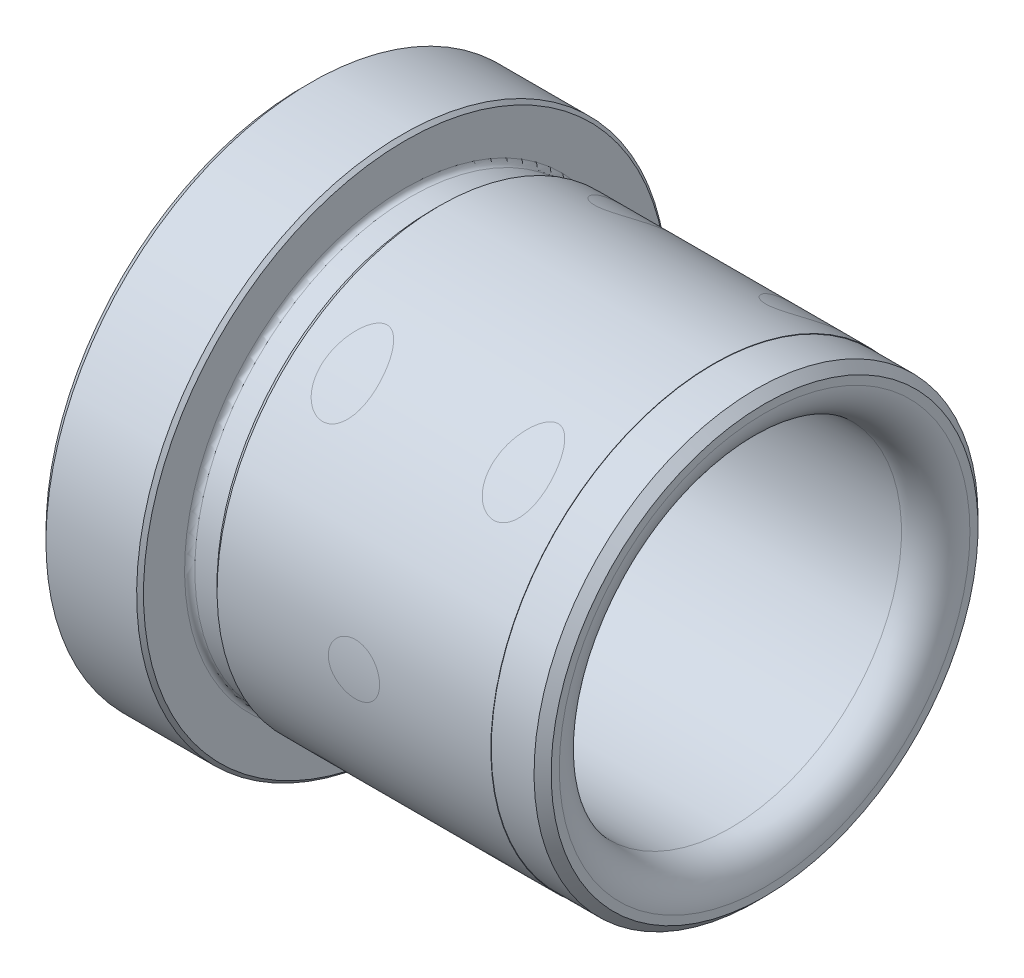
ISO-10303-21;
HEADER;
FILE_DESCRIPTION(('STEP AP214'),'2;1');
FILE_NAME('part.step','',(''),(''),'','','');
FILE_SCHEMA(('AUTOMOTIVE_DESIGN { 1 0 10303 214 1 1 1 1 }'));
ENDSEC;
DATA;
#1=APPLICATION_CONTEXT('core data for automotive mechanical design processes');
#2=APPLICATION_PROTOCOL_DEFINITION('international standard','automotive_design',2000,#1);
#3=PRODUCT_CONTEXT('',#1,'mechanical');
#4=PRODUCT('Part','Part','',(#3));
#5=PRODUCT_RELATED_PRODUCT_CATEGORY('part','',(#4));
#6=PRODUCT_DEFINITION_FORMATION('','',#4);
#7=PRODUCT_DEFINITION_CONTEXT('part definition',#1,'design');
#8=PRODUCT_DEFINITION('design','',#6,#7);
#9=PRODUCT_DEFINITION_SHAPE('','',#8);
#10=(LENGTH_UNIT() NAMED_UNIT(*) SI_UNIT(.MILLI.,.METRE.));
#11=(NAMED_UNIT(*) PLANE_ANGLE_UNIT() SI_UNIT($,.RADIAN.));
#12=(NAMED_UNIT(*) SI_UNIT($,.STERADIAN.) SOLID_ANGLE_UNIT());
#13=UNCERTAINTY_MEASURE_WITH_UNIT(LENGTH_MEASURE(1.E-05),#10,'distance_accuracy_value','');
#14=(GEOMETRIC_REPRESENTATION_CONTEXT(3) GLOBAL_UNCERTAINTY_ASSIGNED_CONTEXT((#13)) GLOBAL_UNIT_ASSIGNED_CONTEXT((#10,
#11,#12)) REPRESENTATION_CONTEXT('',''));
#15=CARTESIAN_POINT('',(0.,0.,0.));
#16=DIRECTION('',(0.,0.,1.));
#17=DIRECTION('',(1.,0.,0.));
#18=AXIS2_PLACEMENT_3D('',#15,#16,#17);
#19=CARTESIAN_POINT('',(13.5,0.,0.));
#20=DIRECTION('',(1.,0.,0.));
#21=DIRECTION('',(0.,1.,0.));
#22=AXIS2_PLACEMENT_3D('',#19,#20,#21);
#23=CYLINDRICAL_SURFACE('',#22,13.);
#24=CARTESIAN_POINT('',(1.,0.,-13.));
#25=CARTESIAN_POINT('',(1.00000359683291,-0.0839563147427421,-12.9999989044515));
#26=CARTESIAN_POINT('',(1.00707241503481,-0.167966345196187,-12.999178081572));
#27=CARTESIAN_POINT('',(1.03516173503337,-0.333652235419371,-12.995982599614));
#28=CARTESIAN_POINT('',(1.05619713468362,-0.415325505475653,-12.9936062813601));
#29=CARTESIAN_POINT('',(1.11159466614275,-0.57391497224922,-12.9875677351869));
#30=CARTESIAN_POINT('',(1.14594820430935,-0.650834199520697,-12.9839063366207));
#31=CARTESIAN_POINT('',(1.22698888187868,-0.797799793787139,-12.9757057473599));
#32=CARTESIAN_POINT('',(1.27367376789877,-0.867847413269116,-12.9711667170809));
#33=CARTESIAN_POINT('',(1.37828803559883,-0.999427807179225,-12.9616943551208));
#34=CARTESIAN_POINT('',(1.43626394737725,-1.06092347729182,-12.9567594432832));
#35=CARTESIAN_POINT('',(1.56171483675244,-1.17333502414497,-12.9470643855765));
#36=CARTESIAN_POINT('',(1.62919027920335,-1.2242503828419,-12.9423042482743));
#37=CARTESIAN_POINT('',(1.77196266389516,-1.3141916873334,-12.9334819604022));
#38=CARTESIAN_POINT('',(1.84728136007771,-1.3531833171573,-12.9294218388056));
#39=CARTESIAN_POINT('',(2.00345216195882,-1.41795120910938,-12.9224797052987));
#40=CARTESIAN_POINT('',(2.08430408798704,-1.44372790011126,-12.9195976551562));
#41=CARTESIAN_POINT('',(2.24886352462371,-1.48122247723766,-12.9153528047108));
#42=CARTESIAN_POINT('',(2.3325566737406,-1.49300261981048,-12.9139832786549));
#43=CARTESIAN_POINT('',(2.50074243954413,-1.50236226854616,-12.9128978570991));
#44=CARTESIAN_POINT('',(2.58523502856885,-1.49994226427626,-12.9131819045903));
#45=CARTESIAN_POINT('',(2.7521893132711,-1.48102150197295,-12.9153653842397));
#46=CARTESIAN_POINT('',(2.8346588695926,-1.46458907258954,-12.9172569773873));
#47=CARTESIAN_POINT('',(2.99566189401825,-1.41821640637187,-12.9224301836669));
#48=CARTESIAN_POINT('',(3.07419529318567,-1.38827593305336,-12.9257118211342));
#49=CARTESIAN_POINT('',(3.2253104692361,-1.31566282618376,-12.9333043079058));
#50=CARTESIAN_POINT('',(3.29787772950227,-1.27296024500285,-12.9376175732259));
#51=CARTESIAN_POINT('',(3.43484172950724,-1.17605655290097,-12.9467853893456));
#52=CARTESIAN_POINT('',(3.49923815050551,-1.12185499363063,-12.9516399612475));
#53=CARTESIAN_POINT('',(3.61842928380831,-1.0031120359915,-12.9613782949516));
#54=CARTESIAN_POINT('',(3.67316529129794,-0.938511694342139,-12.9662620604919));
#55=CARTESIAN_POINT('',(3.77102561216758,-0.80100859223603,-12.9754816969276));
#56=CARTESIAN_POINT('',(3.81414990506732,-0.728105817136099,-12.9798175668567));
#57=CARTESIAN_POINT('',(3.88756171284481,-0.576023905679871,-12.9874550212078));
#58=CARTESIAN_POINT('',(3.91784583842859,-0.496843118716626,-12.9907563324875));
#59=CARTESIAN_POINT('',(3.96467252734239,-0.334473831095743,-12.9959501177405));
#60=CARTESIAN_POINT('',(3.98121563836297,-0.251285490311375,-12.9978426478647));
#61=CARTESIAN_POINT('',(4.00001527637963,-0.0837704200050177,-12.999998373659));
#62=CARTESIAN_POINT('',(4.00235272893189,0.000547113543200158,-13.0002707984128));
#63=CARTESIAN_POINT('',(3.99288784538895,0.168372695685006,-12.9991804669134));
#64=CARTESIAN_POINT('',(3.98108576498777,0.251880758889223,-12.9978177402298));
#65=CARTESIAN_POINT('',(3.943744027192,0.415480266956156,-12.993616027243));
#66=CARTESIAN_POINT('',(3.91824267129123,0.49558056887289,-12.9907811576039));
#67=CARTESIAN_POINT('',(3.85426590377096,0.650367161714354,-12.9839527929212));
#68=CARTESIAN_POINT('',(3.81579011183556,0.725053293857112,-12.9799592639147));
#69=CARTESIAN_POINT('',(3.72675885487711,0.867254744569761,-12.9712363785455));
#70=CARTESIAN_POINT('',(3.67615070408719,0.934736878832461,-12.9665038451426));
#71=CARTESIAN_POINT('',(3.56436625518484,1.06027784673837,-12.9568430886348));
#72=CARTESIAN_POINT('',(3.50318960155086,1.11833636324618,-12.9519148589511));
#73=CARTESIAN_POINT('',(3.37164961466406,1.22366664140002,-12.9423899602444));
#74=CARTESIAN_POINT('',(3.30124335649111,1.27088497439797,-12.9377950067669));
#75=CARTESIAN_POINT('',(3.15345242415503,1.35282617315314,-12.9294843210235));
#76=CARTESIAN_POINT('',(3.07606787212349,1.38754925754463,-12.9257685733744));
#77=CARTESIAN_POINT('',(2.91669384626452,1.44342658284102,-12.9196483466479));
#78=CARTESIAN_POINT('',(2.83471529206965,1.46461162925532,-12.91724089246));
#79=CARTESIAN_POINT('',(2.66833506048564,1.49291104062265,-12.9140010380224));
#80=CARTESIAN_POINT('',(2.58393347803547,1.50002595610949,-12.9131685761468));
#81=CARTESIAN_POINT('',(2.41563434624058,1.49997405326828,-12.9131745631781));
#82=CARTESIAN_POINT('',(2.33173675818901,1.49289116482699,-12.9140031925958));
#83=CARTESIAN_POINT('',(2.16633249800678,1.46482172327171,-12.9172169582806));
#84=CARTESIAN_POINT('',(2.08482582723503,1.44383516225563,-12.9196020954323));
#85=CARTESIAN_POINT('',(1.92652390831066,1.38857911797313,-12.9256572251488));
#86=CARTESIAN_POINT('',(1.84972745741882,1.35431304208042,-12.9293268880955));
#87=CARTESIAN_POINT('',(1.70296159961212,1.27347900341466,-12.9375381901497));
#88=CARTESIAN_POINT('',(1.63299222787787,1.22691097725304,-12.9420798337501));
#89=CARTESIAN_POINT('',(1.50143704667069,1.12248173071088,-12.9515555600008));
#90=CARTESIAN_POINT('',(1.43990107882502,1.06455790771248,-12.9564917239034));
#91=CARTESIAN_POINT('',(1.32738888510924,0.939190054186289,-12.9661816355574));
#92=CARTESIAN_POINT('',(1.27641516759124,0.871743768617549,-12.9709353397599));
#93=CARTESIAN_POINT('',(1.18633643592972,0.728996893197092,-12.9797415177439));
#94=CARTESIAN_POINT('',(1.14727069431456,0.653671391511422,-12.9837916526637));
#95=CARTESIAN_POINT('',(1.08239689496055,0.497527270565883,-12.9907101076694));
#96=CARTESIAN_POINT('',(1.05657420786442,0.416714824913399,-12.993579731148));
#97=CARTESIAN_POINT('',(1.02520714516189,0.27955630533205,-12.9971099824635));
#98=CARTESIAN_POINT('',(1.01576777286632,0.224080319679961,-12.9981885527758));
#99=CARTESIAN_POINT('',(1.00316301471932,0.112410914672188,-12.9996339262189));
#100=CARTESIAN_POINT('',(0.999997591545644,0.0562174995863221,-13.0000007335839));
#101=CARTESIAN_POINT('',(1.,0.,-13.));
#102=B_SPLINE_CURVE_WITH_KNOTS('',3,(#24,#25,#26,#27,#28,#29,#30,#31,#32,#33,#34,#35,#36,#37,
#38,#39,#40,#41,#42,#43,#44,#45,#46,#47,#48,#49,#50,#51,#52,#53,#54,#55,#56,#57,#58,#59,#60,#61,
#62,#63,#64,#65,#66,#67,#68,#69,#70,#71,#72,#73,#74,#75,#76,#77,#78,#79,#80,#81,#82,#83,#84,#85,
#86,#87,#88,#89,#90,#91,#92,#93,#94,#95,#96,#97,#98,#99,#100,#101),.UNSPECIFIED.,.T.,.F.,(4,2,2,
2,2,2,2,2,2,2,2,2,2,2,2,2,2,2,2,2,2,2,2,2,2,2,2,2,2,2,2,2,2,2,2,2,2,2,4),(0.,0.251663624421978,
0.503596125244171,0.755366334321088,1.00709056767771,1.25987498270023,1.51267177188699,
1.76618939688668,2.0196987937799,2.27207631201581,2.52444512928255,2.7755903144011,
3.02673989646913,3.27848351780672,3.53023695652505,3.7834711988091,4.0367058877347,
4.29000737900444,4.54329877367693,4.79514587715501,5.04698842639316,5.29813049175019,
5.54927991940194,5.80154039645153,6.05380936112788,6.30729621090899,6.56077862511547,
6.81368217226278,7.06657582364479,7.31797891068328,7.56938214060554,7.82072090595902,
8.07206096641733,8.3248276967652,8.57765438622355,8.83130609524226,9.08467699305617,
9.25319301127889,9.42170802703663),.UNSPECIFIED.);
#103=CARTESIAN_POINT('',(1.,0.,-13.));
#104=VERTEX_POINT('',#103);
#105=EDGE_CURVE('E34',#104,#104,#102,.T.);
#106=ORIENTED_EDGE('',*,*,#105,.T.);
#107=EDGE_LOOP('',(#106));
#108=FACE_BOUND('',#107,.T.);
#109=CARTESIAN_POINT('',(6.,-10.,-8.30662386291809));
#110=CARTESIAN_POINT('',(6.00000505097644,-10.0682640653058,-8.22444638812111));
#111=CARTESIAN_POINT('',(6.00464907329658,-10.135478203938,-8.14146310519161));
#112=CARTESIAN_POINT('',(6.02253059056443,-10.2674352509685,-7.97440244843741));
#113=CARTESIAN_POINT('',(6.03577140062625,-10.3321771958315,-7.89032466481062));
#114=CARTESIAN_POINT('',(6.07039233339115,-10.4588421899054,-7.72164231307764));
#115=CARTESIAN_POINT('',(6.09177840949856,-10.5207631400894,-7.63703740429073));
#116=CARTESIAN_POINT('',(6.14248424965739,-10.6414317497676,-7.46797856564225));
#117=CARTESIAN_POINT('',(6.17180096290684,-10.7001806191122,-7.38352459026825));
#118=CARTESIAN_POINT('',(6.2291566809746,-10.7982592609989,-7.23898833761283));
#119=CARTESIAN_POINT('',(6.25525873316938,-10.838423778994,-7.17869754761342));
#120=CARTESIAN_POINT('',(6.31181553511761,-10.9168176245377,-7.05891009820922));
#121=CARTESIAN_POINT('',(6.34226940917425,-10.9550473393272,-6.99941328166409));
#122=CARTESIAN_POINT('',(6.40775005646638,-11.0292882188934,-6.88183270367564));
#123=CARTESIAN_POINT('',(6.44276380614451,-11.0653052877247,-6.8237454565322));
#124=CARTESIAN_POINT('',(6.51789942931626,-11.1349459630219,-6.70950413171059));
#125=CARTESIAN_POINT('',(6.55801788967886,-11.1685711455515,-6.65334879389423));
#126=CARTESIAN_POINT('',(6.64248368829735,-11.2318057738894,-6.54601178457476));
#127=CARTESIAN_POINT('',(6.68661445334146,-11.2615188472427,-6.49472240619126));
#128=CARTESIAN_POINT('',(6.78123856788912,-11.3177301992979,-6.39626330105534));
#129=CARTESIAN_POINT('',(6.83173253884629,-11.3442281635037,-6.34909397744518));
#130=CARTESIAN_POINT('',(6.93014578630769,-11.3883850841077,-6.26947875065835));
#131=CARTESIAN_POINT('',(6.9768226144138,-11.4067729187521,-6.2359218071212));
#132=CARTESIAN_POINT('',(7.07556665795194,-11.4396342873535,-6.17543097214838));
#133=CARTESIAN_POINT('',(7.12762054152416,-11.4541171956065,-6.14848123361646));
#134=CARTESIAN_POINT('',(7.22079642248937,-11.4743140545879,-6.11068226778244));
#135=CARTESIAN_POINT('',(7.26064275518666,-11.4813541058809,-6.09742904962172));
#136=CARTESIAN_POINT('',(7.34225962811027,-11.4922486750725,-6.07687073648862));
#137=CARTESIAN_POINT('',(7.384027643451,-11.4961072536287,-6.06955805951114));
#138=CARTESIAN_POINT('',(7.46861615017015,-11.5002715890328,-6.06166447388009));
#139=CARTESIAN_POINT('',(7.51144102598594,-11.5005585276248,-6.06111922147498));
#140=CARTESIAN_POINT('',(7.59649299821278,-11.4974992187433,-6.06692018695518));
#141=CARTESIAN_POINT('',(7.63871972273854,-11.4941508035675,-6.07327051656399));
#142=CARTESIAN_POINT('',(7.72729019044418,-11.4834443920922,-6.09349242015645));
#143=CARTESIAN_POINT('',(7.77335024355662,-11.4755780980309,-6.10831602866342));
#144=CARTESIAN_POINT('',(7.86212413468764,-11.4563448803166,-6.14431260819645));
#145=CARTESIAN_POINT('',(7.90483158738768,-11.4449714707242,-6.16549734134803));
#146=CARTESIAN_POINT('',(8.00920229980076,-11.412493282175,-6.22548754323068));
#147=CARTESIAN_POINT('',(8.06835711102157,-11.3894782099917,-6.26757296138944));
#148=CARTESIAN_POINT('',(8.17894733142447,-11.3389337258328,-6.35856227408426));
#149=CARTESIAN_POINT('',(8.23036132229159,-11.3113922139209,-6.40748439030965));
#150=CARTESIAN_POINT('',(8.32314690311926,-11.2550507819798,-6.50590660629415));
#151=CARTESIAN_POINT('',(8.3649732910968,-11.2264808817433,-6.5551163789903));
#152=CARTESIAN_POINT('',(8.44372949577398,-11.1669673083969,-6.65599554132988));
#153=CARTESIAN_POINT('',(8.48065523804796,-11.1360216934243,-6.70766692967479));
#154=CARTESIAN_POINT('',(8.55021235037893,-11.0720491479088,-6.81274687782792));
#155=CARTESIAN_POINT('',(8.58283530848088,-11.0390183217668,-6.8661585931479));
#156=CARTESIAN_POINT('',(8.64410455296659,-10.9711405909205,-6.97410530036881));
#157=CARTESIAN_POINT('',(8.67274968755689,-10.9362931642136,-7.02864061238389));
#158=CARTESIAN_POINT('',(8.74113366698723,-10.8452172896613,-7.16879229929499));
#159=CARTESIAN_POINT('',(8.77825608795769,-10.7878145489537,-7.25493145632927));
#160=CARTESIAN_POINT('',(8.84405932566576,-10.6693957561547,-7.42798807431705));
#161=CARTESIAN_POINT('',(8.87273543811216,-10.6083777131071,-7.51490594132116));
#162=CARTESIAN_POINT('',(8.92167372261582,-10.4830788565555,-7.68872716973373));
#163=CARTESIAN_POINT('',(8.94193853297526,-10.4187990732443,-7.77563052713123));
#164=CARTESIAN_POINT('',(8.97377434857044,-10.2873300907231,-7.94875229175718));
#165=CARTESIAN_POINT('',(8.98534902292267,-10.2201421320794,-8.03497097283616));
#166=CARTESIAN_POINT('',(9.0031563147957,-10.0450390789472,-8.2538628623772));
#167=CARTESIAN_POINT('',(9.00282737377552,-9.93527461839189,-8.38567557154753));
#168=CARTESIAN_POINT('',(8.97636191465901,-9.71197716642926,-8.6432849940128));
#169=CARTESIAN_POINT('',(8.95028060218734,-9.59845273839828,-8.76909397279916));
#170=CARTESIAN_POINT('',(8.88030540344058,-9.40697068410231,-8.97340941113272));
#171=CARTESIAN_POINT('',(8.84441483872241,-9.32887148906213,-9.05451192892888));
#172=CARTESIAN_POINT('',(8.7560830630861,-9.1753308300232,-9.21005750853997));
#173=CARTESIAN_POINT('',(8.70366255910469,-9.09988617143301,-9.28450875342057));
#174=CARTESIAN_POINT('',(8.59506969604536,-8.97233589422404,-9.40761045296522));
#175=CARTESIAN_POINT('',(8.54267403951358,-8.91891207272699,-9.45821249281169));
#176=CARTESIAN_POINT('',(8.42679922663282,-8.81808657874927,-9.55228142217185));
#177=CARTESIAN_POINT('',(8.36333470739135,-8.7706770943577,-9.5957575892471));
#178=CARTESIAN_POINT('',(8.23861421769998,-8.69279160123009,-9.66631320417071));
#179=CARTESIAN_POINT('',(8.17918093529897,-8.66080752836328,-9.69493859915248));
#180=CARTESIAN_POINT('',(8.05401233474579,-8.60437358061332,-9.74505937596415));
#181=CARTESIAN_POINT('',(7.98827973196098,-8.57992047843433,-9.76655781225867));
#182=CARTESIAN_POINT('',(7.85155377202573,-8.54003093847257,-9.80145853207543));
#183=CARTESIAN_POINT('',(7.78052922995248,-8.52465364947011,-9.81480772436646));
#184=CARTESIAN_POINT('',(7.63589688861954,-8.50438871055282,-9.83237314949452));
#185=CARTESIAN_POINT('',(7.56229054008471,-8.49949526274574,-9.83659443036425));
#186=CARTESIAN_POINT('',(7.42336874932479,-8.50052842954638,-9.83570072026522));
#187=CARTESIAN_POINT('',(7.35803393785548,-8.50532159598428,-9.83156375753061));
#188=CARTESIAN_POINT('',(7.22939875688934,-8.52318244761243,-9.81608368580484));
#189=CARTESIAN_POINT('',(7.16609821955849,-8.53624944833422,-9.80474117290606));
#190=CARTESIAN_POINT('',(7.04352559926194,-8.56973852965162,-9.77548291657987));
#191=CARTESIAN_POINT('',(6.98423194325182,-8.59011674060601,-9.75760636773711));
#192=CARTESIAN_POINT('',(6.87039680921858,-8.63713647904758,-9.71601030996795));
#193=CARTESIAN_POINT('',(6.81585659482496,-8.66377966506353,-9.6922892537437));
#194=CARTESIAN_POINT('',(6.70616421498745,-8.72554500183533,-9.63674089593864));
#195=CARTESIAN_POINT('',(6.65168340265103,-8.76129379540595,-9.60429065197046));
#196=CARTESIAN_POINT('',(6.54988774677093,-8.83752864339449,-9.53419018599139));
#197=CARTESIAN_POINT('',(6.50257781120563,-8.87801790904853,-9.4965364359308));
#198=CARTESIAN_POINT('',(6.39072986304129,-8.98586641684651,-9.39480101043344));
#199=CARTESIAN_POINT('',(6.33126307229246,-9.05563592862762,-9.32767638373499));
#200=CARTESIAN_POINT('',(6.22845543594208,-9.19936367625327,-9.1859669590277));
#201=CARTESIAN_POINT('',(6.18515298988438,-9.27333141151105,-9.11136492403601));
#202=CARTESIAN_POINT('',(6.09655560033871,-9.45688919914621,-8.92141547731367));
#203=CARTESIAN_POINT('',(6.05942593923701,-9.56728315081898,-8.8030515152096));
#204=CARTESIAN_POINT('',(6.01111897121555,-9.78596109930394,-8.55931979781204));
#205=CARTESIAN_POINT('',(5.99999217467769,-9.89424058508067,-8.43393889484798));
#206=CARTESIAN_POINT('',(6.,-10.,-8.30662386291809));
#207=B_SPLINE_CURVE_WITH_KNOTS('',3,(#109,#110,#111,#112,#113,#114,#115,#116,#117,#118,#119,
#120,#121,#122,#123,#124,#125,#126,#127,#128,#129,#130,#131,#132,#133,#134,#135,#136,#137,#138,
#139,#140,#141,#142,#143,#144,#145,#146,#147,#148,#149,#150,#151,#152,#153,#154,#155,#156,#157,
#158,#159,#160,#161,#162,#163,#164,#165,#166,#167,#168,#169,#170,#171,#172,#173,#174,#175,#176,
#177,#178,#179,#180,#181,#182,#183,#184,#185,#186,#187,#188,#189,#190,#191,#192,#193,#194,#195,
#196,#197,#198,#199,#200,#201,#202,#203,#204,#205,#206),.UNSPECIFIED.,.T.,.F.,(4,2,2,2,2,2,2,2,
2,2,2,2,2,2,2,2,2,2,2,2,2,2,2,2,2,2,2,2,2,2,2,2,2,2,2,2,2,2,2,2,2,2,2,2,2,2,2,2,4),(0.,
0.320317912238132,0.640759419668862,0.961435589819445,1.28198857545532,1.51286551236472,
1.74369605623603,1.97388121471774,2.20391326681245,2.42526916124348,2.64664669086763,
2.82719865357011,3.00731323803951,3.13456295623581,3.26165000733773,3.38940637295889,
3.51723895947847,3.66349416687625,3.81002149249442,4.037217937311,4.26503190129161,
4.47659031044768,4.68832352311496,4.90046472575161,5.11266722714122,5.44212804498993,
5.77177201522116,6.10131251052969,6.43071379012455,6.94350128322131,7.45519188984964,
7.80863490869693,8.16163691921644,8.43168228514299,8.70137322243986,8.92042700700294,
9.13938678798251,9.359758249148,9.58000780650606,9.77597447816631,9.97192494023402,
10.166718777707,10.3615642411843,10.5791480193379,10.7968800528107,11.1358237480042,
11.4755675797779,11.9708649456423,12.4671236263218),.UNSPECIFIED.);
#208=CARTESIAN_POINT('',(6.,-10.,-8.30662386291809));
#209=VERTEX_POINT('',#208);
#210=EDGE_CURVE('E51',#209,#209,#207,.T.);
#211=ORIENTED_EDGE('',*,*,#210,.T.);
#212=EDGE_LOOP('',(#211));
#213=FACE_BOUND('',#212,.T.);
#214=CARTESIAN_POINT('',(-4.,-10.,-8.30662386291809));
#215=CARTESIAN_POINT('',(-3.99999494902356,-10.0682640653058,-8.22444638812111));
#216=CARTESIAN_POINT('',(-3.99535092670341,-10.135478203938,-8.14146310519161));
#217=CARTESIAN_POINT('',(-3.97746940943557,-10.2674352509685,-7.97440244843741));
#218=CARTESIAN_POINT('',(-3.96422859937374,-10.3321771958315,-7.89032466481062));
#219=CARTESIAN_POINT('',(-3.92960766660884,-10.4588421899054,-7.72164231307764));
#220=CARTESIAN_POINT('',(-3.90822159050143,-10.5207631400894,-7.63703740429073));
#221=CARTESIAN_POINT('',(-3.8575157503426,-10.6414317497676,-7.46797856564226));
#222=CARTESIAN_POINT('',(-3.82819903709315,-10.7001806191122,-7.38352459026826));
#223=CARTESIAN_POINT('',(-3.77084331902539,-10.7982592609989,-7.23898833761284));
#224=CARTESIAN_POINT('',(-3.74474126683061,-10.838423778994,-7.17869754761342));
#225=CARTESIAN_POINT('',(-3.68818446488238,-10.9168176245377,-7.05891009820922));
#226=CARTESIAN_POINT('',(-3.65773059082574,-10.9550473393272,-6.99941328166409));
#227=CARTESIAN_POINT('',(-3.59224994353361,-11.0292882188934,-6.88183270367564));
#228=CARTESIAN_POINT('',(-3.55723619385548,-11.0653052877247,-6.82374545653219));
#229=CARTESIAN_POINT('',(-3.48210057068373,-11.1349459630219,-6.70950413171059));
#230=CARTESIAN_POINT('',(-3.44198211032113,-11.1685711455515,-6.65334879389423));
#231=CARTESIAN_POINT('',(-3.35751631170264,-11.2318057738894,-6.54601178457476));
#232=CARTESIAN_POINT('',(-3.31338554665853,-11.2615188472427,-6.49472240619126));
#233=CARTESIAN_POINT('',(-3.21876143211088,-11.3177301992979,-6.39626330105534));
#234=CARTESIAN_POINT('',(-3.1682674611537,-11.3442281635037,-6.34909397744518));
#235=CARTESIAN_POINT('',(-3.0698542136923,-11.3883850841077,-6.26947875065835));
#236=CARTESIAN_POINT('',(-3.02317738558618,-11.4067729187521,-6.2359218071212));
#237=CARTESIAN_POINT('',(-2.92443334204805,-11.4396342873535,-6.17543097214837));
#238=CARTESIAN_POINT('',(-2.87237945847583,-11.4541171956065,-6.14848123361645));
#239=CARTESIAN_POINT('',(-2.77920357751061,-11.4743140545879,-6.11068226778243));
#240=CARTESIAN_POINT('',(-2.73935724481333,-11.4813541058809,-6.09742904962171));
#241=CARTESIAN_POINT('',(-2.65774037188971,-11.4922486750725,-6.07687073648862));
#242=CARTESIAN_POINT('',(-2.61597235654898,-11.4961072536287,-6.06955805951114));
#243=CARTESIAN_POINT('',(-2.53138384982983,-11.5002715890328,-6.06166447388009));
#244=CARTESIAN_POINT('',(-2.48855897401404,-11.5005585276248,-6.06111922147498));
#245=CARTESIAN_POINT('',(-2.40350700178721,-11.4974992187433,-6.06692018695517));
#246=CARTESIAN_POINT('',(-2.36128027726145,-11.4941508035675,-6.07327051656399));
#247=CARTESIAN_POINT('',(-2.2727098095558,-11.4834443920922,-6.09349242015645));
#248=CARTESIAN_POINT('',(-2.22664975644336,-11.4755780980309,-6.10831602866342));
#249=CARTESIAN_POINT('',(-2.13787586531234,-11.4563448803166,-6.14431260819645));
#250=CARTESIAN_POINT('',(-2.0951684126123,-11.4449714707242,-6.16549734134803));
#251=CARTESIAN_POINT('',(-1.99079770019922,-11.412493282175,-6.22548754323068));
#252=CARTESIAN_POINT('',(-1.93164288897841,-11.3894782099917,-6.26757296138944));
#253=CARTESIAN_POINT('',(-1.82105266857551,-11.3389337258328,-6.35856227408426));
#254=CARTESIAN_POINT('',(-1.76963867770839,-11.3113922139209,-6.40748439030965));
#255=CARTESIAN_POINT('',(-1.67685309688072,-11.2550507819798,-6.50590660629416));
#256=CARTESIAN_POINT('',(-1.63502670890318,-11.2264808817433,-6.55511637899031));
#257=CARTESIAN_POINT('',(-1.556270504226,-11.1669673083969,-6.65599554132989));
#258=CARTESIAN_POINT('',(-1.51934476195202,-11.1360216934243,-6.7076669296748));
#259=CARTESIAN_POINT('',(-1.44978764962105,-11.0720491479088,-6.81274687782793));
#260=CARTESIAN_POINT('',(-1.4171646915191,-11.0390183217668,-6.86615859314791));
#261=CARTESIAN_POINT('',(-1.35589544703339,-10.9711405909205,-6.97410530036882));
#262=CARTESIAN_POINT('',(-1.32725031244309,-10.9362931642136,-7.0286406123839));
#263=CARTESIAN_POINT('',(-1.25886633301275,-10.8452172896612,-7.168792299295));
#264=CARTESIAN_POINT('',(-1.22174391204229,-10.7878145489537,-7.25493145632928));
#265=CARTESIAN_POINT('',(-1.15594067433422,-10.6693957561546,-7.42798807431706));
#266=CARTESIAN_POINT('',(-1.12726456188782,-10.608377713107,-7.51490594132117));
#267=CARTESIAN_POINT('',(-1.07832627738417,-10.4830788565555,-7.68872716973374));
#268=CARTESIAN_POINT('',(-1.05806146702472,-10.4187990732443,-7.77563052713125));
#269=CARTESIAN_POINT('',(-1.02622565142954,-10.2873300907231,-7.94875229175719));
#270=CARTESIAN_POINT('',(-1.01465097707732,-10.2201421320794,-8.03497097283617));
#271=CARTESIAN_POINT('',(-0.996843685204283,-10.0450390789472,-8.25386286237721));
#272=CARTESIAN_POINT('',(-0.997172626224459,-9.93527461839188,-8.38567557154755));
#273=CARTESIAN_POINT('',(-1.02363808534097,-9.71197716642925,-8.64328499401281));
#274=CARTESIAN_POINT('',(-1.04971939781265,-9.59845273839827,-8.76909397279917));
#275=CARTESIAN_POINT('',(-1.1196945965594,-9.40697068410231,-8.97340941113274));
#276=CARTESIAN_POINT('',(-1.15558516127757,-9.32887148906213,-9.05451192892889));
#277=CARTESIAN_POINT('',(-1.24391693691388,-9.1753308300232,-9.21005750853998));
#278=CARTESIAN_POINT('',(-1.2963374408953,-9.099886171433,-9.28450875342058));
#279=CARTESIAN_POINT('',(-1.40493030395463,-8.97233589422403,-9.40761045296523));
#280=CARTESIAN_POINT('',(-1.45732596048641,-8.91891207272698,-9.4582124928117));
#281=CARTESIAN_POINT('',(-1.57320077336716,-8.81808657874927,-9.55228142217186));
#282=CARTESIAN_POINT('',(-1.63666529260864,-8.7706770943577,-9.59575758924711));
#283=CARTESIAN_POINT('',(-1.76138578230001,-8.69279160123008,-9.66631320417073));
#284=CARTESIAN_POINT('',(-1.82081906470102,-8.66080752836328,-9.69493859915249));
#285=CARTESIAN_POINT('',(-1.94598766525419,-8.60437358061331,-9.74505937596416));
#286=CARTESIAN_POINT('',(-2.01172026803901,-8.57992047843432,-9.76655781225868));
#287=CARTESIAN_POINT('',(-2.14844622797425,-8.54003093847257,-9.80145853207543));
#288=CARTESIAN_POINT('',(-2.21947077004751,-8.5246536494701,-9.81480772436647));
#289=CARTESIAN_POINT('',(-2.36410311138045,-8.50438871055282,-9.83237314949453));
#290=CARTESIAN_POINT('',(-2.43770945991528,-8.49949526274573,-9.83659443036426));
#291=CARTESIAN_POINT('',(-2.57663125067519,-8.50052842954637,-9.83570072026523));
#292=CARTESIAN_POINT('',(-2.64196606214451,-8.50532159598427,-9.83156375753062));
#293=CARTESIAN_POINT('',(-2.77060124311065,-8.52318244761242,-9.81608368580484));
#294=CARTESIAN_POINT('',(-2.83390178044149,-8.53624944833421,-9.80474117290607));
#295=CARTESIAN_POINT('',(-2.95647440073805,-8.56973852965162,-9.77548291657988));
#296=CARTESIAN_POINT('',(-3.01576805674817,-8.59011674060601,-9.75760636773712));
#297=CARTESIAN_POINT('',(-3.12960319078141,-8.63713647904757,-9.71601030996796));
#298=CARTESIAN_POINT('',(-3.18414340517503,-8.66377966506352,-9.6922892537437));
#299=CARTESIAN_POINT('',(-3.29383578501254,-8.72554500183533,-9.63674089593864));
#300=CARTESIAN_POINT('',(-3.34831659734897,-8.76129379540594,-9.60429065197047));
#301=CARTESIAN_POINT('',(-3.45011225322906,-8.83752864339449,-9.5341901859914));
#302=CARTESIAN_POINT('',(-3.49742218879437,-8.87801790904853,-9.4965364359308));
#303=CARTESIAN_POINT('',(-3.6092701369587,-8.98586641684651,-9.39480101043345));
#304=CARTESIAN_POINT('',(-3.66873692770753,-9.05563592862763,-9.32767638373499));
#305=CARTESIAN_POINT('',(-3.77154456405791,-9.19936367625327,-9.18596695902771));
#306=CARTESIAN_POINT('',(-3.81484701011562,-9.27333141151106,-9.11136492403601));
#307=CARTESIAN_POINT('',(-3.90344439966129,-9.45688919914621,-8.92141547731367));
#308=CARTESIAN_POINT('',(-3.94057406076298,-9.56728315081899,-8.8030515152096));
#309=CARTESIAN_POINT('',(-3.98888102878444,-9.78596109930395,-8.55931979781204));
#310=CARTESIAN_POINT('',(-4.0000078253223,-9.89424058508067,-8.43393889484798));
#311=CARTESIAN_POINT('',(-4.,-10.,-8.30662386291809));
#312=B_SPLINE_CURVE_WITH_KNOTS('',3,(#214,#215,#216,#217,#218,#219,#220,#221,#222,#223,#224,
#225,#226,#227,#228,#229,#230,#231,#232,#233,#234,#235,#236,#237,#238,#239,#240,#241,#242,#243,
#244,#245,#246,#247,#248,#249,#250,#251,#252,#253,#254,#255,#256,#257,#258,#259,#260,#261,#262,
#263,#264,#265,#266,#267,#268,#269,#270,#271,#272,#273,#274,#275,#276,#277,#278,#279,#280,#281,
#282,#283,#284,#285,#286,#287,#288,#289,#290,#291,#292,#293,#294,#295,#296,#297,#298,#299,#300,
#301,#302,#303,#304,#305,#306,#307,#308,#309,#310,#311),.UNSPECIFIED.,.T.,.F.,(4,2,2,2,2,2,2,2,
2,2,2,2,2,2,2,2,2,2,2,2,2,2,2,2,2,2,2,2,2,2,2,2,2,2,2,2,2,2,2,2,2,2,2,2,2,2,2,2,4),(0.,
0.320317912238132,0.640759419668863,0.961435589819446,1.28198857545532,1.51286551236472,
1.74369605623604,1.97388121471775,2.20391326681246,2.42526916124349,2.64664669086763,
2.82719865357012,3.00731323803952,3.13456295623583,3.26165000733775,3.3894063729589,
3.51723895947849,3.66349416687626,3.81002149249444,4.03721793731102,4.26503190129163,
4.47659031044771,4.68832352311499,4.90046472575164,5.11266722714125,5.44212804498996,
5.77177201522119,6.10131251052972,6.43071379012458,6.94350128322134,7.45519188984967,
7.80863490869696,8.16163691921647,8.43168228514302,8.70137322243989,8.92042700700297,
9.13938678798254,9.35975824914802,9.58000780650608,9.77597447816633,9.97192494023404,
10.1667187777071,10.3615642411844,10.5791480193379,10.7968800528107,11.1358237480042,
11.4755675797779,11.9708649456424,12.4671236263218),.UNSPECIFIED.);
#313=CARTESIAN_POINT('',(-4.,-10.,-8.30662386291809));
#314=VERTEX_POINT('',#313);
#315=EDGE_CURVE('E98',#314,#314,#312,.T.);
#316=ORIENTED_EDGE('',*,*,#315,.T.);
#317=EDGE_LOOP('',(#316));
#318=FACE_BOUND('',#317,.T.);
#319=CARTESIAN_POINT('',(6.,10.,-8.30662386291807));
#320=CARTESIAN_POINT('',(6.00000148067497,9.94355607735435,-8.37457376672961));
#321=CARTESIAN_POINT('',(6.00318333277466,9.88641473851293,-8.44194958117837));
#322=CARTESIAN_POINT('',(6.01642764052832,9.77112175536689,-8.575137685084));
#323=CARTESIAN_POINT('',(6.02649269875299,9.71296973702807,-8.64094937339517));
#324=CARTESIAN_POINT('',(6.06790012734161,9.53803126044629,-8.83492350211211));
#325=CARTESIAN_POINT('',(6.1104432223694,9.42023151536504,-8.96026302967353));
#326=CARTESIAN_POINT('',(6.20640220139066,9.23679778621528,-9.1482892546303));
#327=CARTESIAN_POINT('',(6.2481437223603,9.16964126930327,-9.21553683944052));
#328=CARTESIAN_POINT('',(6.34532849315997,9.03909547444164,-9.34360932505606));
#329=CARTESIAN_POINT('',(6.40075721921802,8.97570229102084,-9.40444093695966));
#330=CARTESIAN_POINT('',(6.51431318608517,8.86713856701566,-9.50675299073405));
#331=CARTESIAN_POINT('',(6.56996031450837,8.8207860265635,-9.5497193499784));
#332=CARTESIAN_POINT('',(6.69080681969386,8.73481853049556,-9.62841269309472));
#333=CARTESIAN_POINT('',(6.75599494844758,8.69519575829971,-9.66414808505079));
#334=CARTESIAN_POINT('',(6.88329425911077,8.63111038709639,-9.72139222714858));
#335=CARTESIAN_POINT('',(6.94405860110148,8.60521692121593,-9.74428520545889));
#336=CARTESIAN_POINT('',(7.07051494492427,8.56124558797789,-9.78294104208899));
#337=CARTESIAN_POINT('',(7.1362046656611,8.54316412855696,-9.79870717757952));
#338=CARTESIAN_POINT('',(7.27114167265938,8.51595815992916,-9.8223617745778));
#339=CARTESIAN_POINT('',(7.3404040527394,8.50687560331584,-9.83021334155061));
#340=CARTESIAN_POINT('',(7.47995700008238,8.49850758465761,-9.83744901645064));
#341=CARTESIAN_POINT('',(7.55024730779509,8.49921969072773,-9.83683522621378));
#342=CARTESIAN_POINT('',(7.68384546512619,8.50992245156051,-9.82757641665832));
#343=CARTESIAN_POINT('',(7.74726137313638,8.51916477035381,-9.81957911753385));
#344=CARTESIAN_POINT('',(7.87122814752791,8.54528234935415,-9.79685900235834));
#345=CARTESIAN_POINT('',(7.93177899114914,8.56215767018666,-9.78213613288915));
#346=CARTESIAN_POINT('',(8.0504716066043,8.60320171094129,-9.74605982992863));
#347=CARTESIAN_POINT('',(8.1084836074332,8.62757714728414,-9.72451789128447));
#348=CARTESIAN_POINT('',(8.21912092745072,8.68216892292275,-9.67580919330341));
#349=CARTESIAN_POINT('',(8.27174344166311,8.71238828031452,-9.64863952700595));
#350=CARTESIAN_POINT('',(8.39182423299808,8.79098389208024,-9.5771837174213));
#351=CARTESIAN_POINT('',(8.45633416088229,8.8416805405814,-9.53048153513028));
#352=CARTESIAN_POINT('',(8.57334633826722,8.9491573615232,-9.42963678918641));
#353=CARTESIAN_POINT('',(8.62582492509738,9.00594920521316,-9.37547989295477));
#354=CARTESIAN_POINT('',(8.73645915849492,9.14462673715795,-9.2405735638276));
#355=CARTESIAN_POINT('',(8.78963478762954,9.22807504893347,-9.15735708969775));
#356=CARTESIAN_POINT('',(8.87687014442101,9.39724261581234,-8.98368869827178));
#357=CARTESIAN_POINT('',(8.91090008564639,9.48296519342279,-8.89322575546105));
#358=CARTESIAN_POINT('',(8.97300495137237,9.68969651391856,-8.66842886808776));
#359=CARTESIAN_POINT('',(8.99265984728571,9.81049295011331,-8.53154904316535));
#360=CARTESIAN_POINT('',(9.001111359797,9.98747972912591,-8.32218427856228));
#361=CARTESIAN_POINT('',(9.00040838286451,10.0458488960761,-8.25162521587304));
#362=CARTESIAN_POINT('',(8.99245832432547,10.1609091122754,-8.10951566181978));
#363=CARTESIAN_POINT('',(8.98521358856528,10.2176007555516,-8.0379655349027));
#364=CARTESIAN_POINT('',(8.96422778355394,10.3308507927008,-7.89191671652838));
#365=CARTESIAN_POINT('',(8.95028268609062,10.3873446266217,-7.81739792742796));
#366=CARTESIAN_POINT('',(8.91609474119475,10.4980256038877,-7.66812144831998));
#367=CARTESIAN_POINT('',(8.89585338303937,10.5522132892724,-7.59336381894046));
#368=CARTESIAN_POINT('',(8.84919699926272,10.6580339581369,-7.44410311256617));
#369=CARTESIAN_POINT('',(8.82278916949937,10.7096698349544,-7.36959984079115));
#370=CARTESIAN_POINT('',(8.76369799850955,10.8102262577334,-7.22129019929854));
#371=CARTESIAN_POINT('',(8.73101692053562,10.859147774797,-7.14748358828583));
#372=CARTESIAN_POINT('',(8.65085732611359,10.9648210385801,-6.98456414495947));
#373=CARTESIAN_POINT('',(8.60170381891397,11.0208278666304,-6.89578188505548));
#374=CARTESIAN_POINT('',(8.49209207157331,11.127664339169,-6.72201136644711));
#375=CARTESIAN_POINT('',(8.43163730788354,11.1784955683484,-6.63702195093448));
#376=CARTESIAN_POINT('',(8.3161118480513,11.2599319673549,-6.49757608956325));
#377=CARTESIAN_POINT('',(8.2644029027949,11.292177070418,-6.44131225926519));
#378=CARTESIAN_POINT('',(8.15251941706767,11.3521245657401,-6.33505669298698));
#379=CARTESIAN_POINT('',(8.09236500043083,11.3798374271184,-6.28505056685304));
#380=CARTESIAN_POINT('',(7.98767284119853,11.419139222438,-6.21323080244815));
#381=CARTESIAN_POINT('',(7.9462475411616,11.4327919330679,-6.18804657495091));
#382=CARTESIAN_POINT('',(7.85962483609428,11.456943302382,-6.14321535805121));
#383=CARTESIAN_POINT('',(7.81443329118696,11.467446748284,-6.12355996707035));
#384=CARTESIAN_POINT('',(7.72880010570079,11.4829710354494,-6.09439122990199));
#385=CARTESIAN_POINT('',(7.68887619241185,11.4886237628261,-6.08371563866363));
#386=CARTESIAN_POINT('',(7.60756433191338,11.4966941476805,-6.06845127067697));
#387=CARTESIAN_POINT('',(7.56617792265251,11.4991151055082,-6.06385628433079));
#388=CARTESIAN_POINT('',(7.48302007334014,11.5004814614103,-6.06126465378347));
#389=CARTESIAN_POINT('',(7.44124788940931,11.4994173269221,-6.06328610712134));
#390=CARTESIAN_POINT('',(7.35873801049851,11.4939076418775,-6.07372369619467));
#391=CARTESIAN_POINT('',(7.3180012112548,11.489459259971,-6.08214518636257));
#392=CARTESIAN_POINT('',(7.22907481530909,11.4761691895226,-6.10719102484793));
#393=CARTESIAN_POINT('',(7.18142729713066,11.4665322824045,-6.12529354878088));
#394=CARTESIAN_POINT('',(7.09003830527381,11.4436631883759,-6.16791366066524));
#395=CARTESIAN_POINT('',(7.04630540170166,11.4304233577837,-6.19244488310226));
#396=CARTESIAN_POINT('',(6.93722553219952,11.3922585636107,-6.26249453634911));
#397=CARTESIAN_POINT('',(6.8750288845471,11.3651409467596,-6.31166961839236));
#398=CARTESIAN_POINT('',(6.75944018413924,11.3060620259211,-6.41690280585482));
#399=CARTESIAN_POINT('',(6.70607296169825,11.2740875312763,-6.47297957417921));
#400=CARTESIAN_POINT('',(6.60991468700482,11.2086767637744,-6.58555507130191));
#401=CARTESIAN_POINT('',(6.56666603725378,11.1754639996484,-6.64179848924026));
#402=CARTESIAN_POINT('',(6.48574090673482,11.106395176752,-6.75666230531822));
#403=CARTESIAN_POINT('',(6.44806902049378,11.0705369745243,-6.81528461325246));
#404=CARTESIAN_POINT('',(6.37765716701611,10.9964737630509,-6.9341530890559));
#405=CARTESIAN_POINT('',(6.34492616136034,10.9582646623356,-6.99440197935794));
#406=CARTESIAN_POINT('',(6.28407966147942,10.8797741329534,-7.11588014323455));
#407=CARTESIAN_POINT('',(6.25596534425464,10.8394921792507,-7.17710966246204));
#408=CARTESIAN_POINT('',(6.1926150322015,10.7387119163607,-7.32744757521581));
#409=CARTESIAN_POINT('',(6.15975545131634,10.6771751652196,-7.41686944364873));
#410=CARTESIAN_POINT('',(6.10293311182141,10.550475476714,-7.59601995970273));
#411=CARTESIAN_POINT('',(6.07897471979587,10.4853107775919,-7.68574873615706));
#412=CARTESIAN_POINT('',(6.04016257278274,10.3517256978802,-7.86474678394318));
#413=CARTESIAN_POINT('',(6.02530782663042,10.2833056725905,-7.95401610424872));
#414=CARTESIAN_POINT('',(6.005227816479,10.143638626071,-8.13137934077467));
#415=CARTESIAN_POINT('',(5.99999810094,10.0723929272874,-8.21947378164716));
#416=CARTESIAN_POINT('',(6.,10.,-8.30662386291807));
#417=B_SPLINE_CURVE_WITH_KNOTS('',3,(#319,#320,#321,#322,#323,#324,#325,#326,#327,#328,#329,
#330,#331,#332,#333,#334,#335,#336,#337,#338,#339,#340,#341,#342,#343,#344,#345,#346,#347,#348,
#349,#350,#351,#352,#353,#354,#355,#356,#357,#358,#359,#360,#361,#362,#363,#364,#365,#366,#367,
#368,#369,#370,#371,#372,#373,#374,#375,#376,#377,#378,#379,#380,#381,#382,#383,#384,#385,#386,
#387,#388,#389,#390,#391,#392,#393,#394,#395,#396,#397,#398,#399,#400,#401,#402,#403,#404,#405,
#406,#407,#408,#409,#410,#411,#412,#413,#414,#415,#416),.UNSPECIFIED.,.T.,.F.,(4,2,2,2,2,2,2,2,
2,2,2,2,2,2,2,2,2,2,2,2,2,2,2,2,2,2,2,2,2,2,2,2,2,2,2,2,2,2,2,2,2,2,2,2,2,2,2,2,4),(0.,
0.264913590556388,0.529927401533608,1.05749242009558,1.36800706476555,1.67819362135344,
1.92988457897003,2.18128116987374,2.39012541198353,2.59887352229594,2.80859029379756,
3.01825499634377,3.21111315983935,3.4039728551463,3.60271372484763,3.80155750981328,
4.08321217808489,4.3654161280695,4.75114775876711,5.13747785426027,5.68512524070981,
5.95968090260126,6.2341381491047,6.51754029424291,6.80087545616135,7.08388162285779,
7.3667858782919,7.71393897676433,8.06098546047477,8.30929369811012,8.55702000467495,
8.70771137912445,8.85817251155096,8.9827855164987,9.10727116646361,9.23209759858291,
9.35702857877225,9.51178029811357,9.66686292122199,9.91684749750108,10.1675235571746,
10.4022020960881,10.637072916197,10.8723647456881,11.10771646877,11.4475128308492,
11.7874756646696,12.1274014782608,12.467170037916),.UNSPECIFIED.);
#418=CARTESIAN_POINT('',(6.,10.,-8.30662386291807));
#419=VERTEX_POINT('',#418);
#420=EDGE_CURVE('E85',#419,#419,#417,.T.);
#421=ORIENTED_EDGE('',*,*,#420,.T.);
#422=EDGE_LOOP('',(#421));
#423=FACE_BOUND('',#422,.T.);
#424=CARTESIAN_POINT('',(-4.,10.,-8.30662386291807));
#425=CARTESIAN_POINT('',(-3.99999851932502,9.94355607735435,-8.37457376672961));
#426=CARTESIAN_POINT('',(-3.99681666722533,9.88641473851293,-8.44194958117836));
#427=CARTESIAN_POINT('',(-3.98357235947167,9.77112175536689,-8.575137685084));
#428=CARTESIAN_POINT('',(-3.97350730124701,9.71296973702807,-8.64094937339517));
#429=CARTESIAN_POINT('',(-3.93209987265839,9.53803126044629,-8.83492350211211));
#430=CARTESIAN_POINT('',(-3.88955677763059,9.42023151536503,-8.96026302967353));
#431=CARTESIAN_POINT('',(-3.79359779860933,9.23679778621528,-9.1482892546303));
#432=CARTESIAN_POINT('',(-3.75185627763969,9.16964126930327,-9.21553683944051));
#433=CARTESIAN_POINT('',(-3.65467150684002,9.03909547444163,-9.34360932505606));
#434=CARTESIAN_POINT('',(-3.59924278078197,8.97570229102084,-9.40444093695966));
#435=CARTESIAN_POINT('',(-3.48568681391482,8.86713856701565,-9.50675299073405));
#436=CARTESIAN_POINT('',(-3.43003968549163,8.82078602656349,-9.54971934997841));
#437=CARTESIAN_POINT('',(-3.30919318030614,8.73481853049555,-9.62841269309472));
#438=CARTESIAN_POINT('',(-3.24400505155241,8.69519575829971,-9.66414808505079));
#439=CARTESIAN_POINT('',(-3.11670574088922,8.63111038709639,-9.72139222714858));
#440=CARTESIAN_POINT('',(-3.05594139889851,8.60521692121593,-9.74428520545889));
#441=CARTESIAN_POINT('',(-2.92948505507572,8.56124558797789,-9.78294104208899));
#442=CARTESIAN_POINT('',(-2.86379533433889,8.54316412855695,-9.79870717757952));
#443=CARTESIAN_POINT('',(-2.72885832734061,8.51595815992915,-9.8223617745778));
#444=CARTESIAN_POINT('',(-2.65959594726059,8.50687560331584,-9.83021334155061));
#445=CARTESIAN_POINT('',(-2.52004299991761,8.4985075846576,-9.83744901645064));
#446=CARTESIAN_POINT('',(-2.4497526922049,8.49921969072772,-9.83683522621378));
#447=CARTESIAN_POINT('',(-2.3161545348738,8.50992245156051,-9.82757641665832));
#448=CARTESIAN_POINT('',(-2.25273862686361,8.5191647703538,-9.81957911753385));
#449=CARTESIAN_POINT('',(-2.12877185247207,8.54528234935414,-9.79685900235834));
#450=CARTESIAN_POINT('',(-2.06822100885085,8.56215767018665,-9.78213613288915));
#451=CARTESIAN_POINT('',(-1.94952839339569,8.60320171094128,-9.74605982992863));
#452=CARTESIAN_POINT('',(-1.89151639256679,8.62757714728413,-9.72451789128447));
#453=CARTESIAN_POINT('',(-1.78087907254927,8.68216892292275,-9.67580919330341));
#454=CARTESIAN_POINT('',(-1.72825655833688,8.71238828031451,-9.64863952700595));
#455=CARTESIAN_POINT('',(-1.60817576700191,8.79098389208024,-9.5771837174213));
#456=CARTESIAN_POINT('',(-1.5436658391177,8.8416805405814,-9.53048153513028));
#457=CARTESIAN_POINT('',(-1.42665366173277,8.9491573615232,-9.42963678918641));
#458=CARTESIAN_POINT('',(-1.3741750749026,9.00594920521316,-9.37547989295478));
#459=CARTESIAN_POINT('',(-1.26354084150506,9.14462673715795,-9.2405735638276));
#460=CARTESIAN_POINT('',(-1.21036521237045,9.22807504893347,-9.15735708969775));
#461=CARTESIAN_POINT('',(-1.12312985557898,9.39724261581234,-8.98368869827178));
#462=CARTESIAN_POINT('',(-1.08909991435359,9.48296519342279,-8.89322575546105));
#463=CARTESIAN_POINT('',(-1.02699504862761,9.68969651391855,-8.66842886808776));
#464=CARTESIAN_POINT('',(-1.00734015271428,9.8104929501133,-8.53154904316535));
#465=CARTESIAN_POINT('',(-0.998888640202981,9.9874797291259,-8.32218427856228));
#466=CARTESIAN_POINT('',(-0.999591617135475,10.0458488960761,-8.25162521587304));
#467=CARTESIAN_POINT('',(-1.00754167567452,10.1609091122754,-8.10951566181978));
#468=CARTESIAN_POINT('',(-1.01478641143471,10.2176007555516,-8.0379655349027));
#469=CARTESIAN_POINT('',(-1.03577221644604,10.3308507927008,-7.89191671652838));
#470=CARTESIAN_POINT('',(-1.04971731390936,10.3873446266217,-7.81739792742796));
#471=CARTESIAN_POINT('',(-1.08390525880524,10.4980256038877,-7.66812144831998));
#472=CARTESIAN_POINT('',(-1.10414661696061,10.5522132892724,-7.59336381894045));
#473=CARTESIAN_POINT('',(-1.15080300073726,10.6580339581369,-7.44410311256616));
#474=CARTESIAN_POINT('',(-1.17721083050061,10.7096698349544,-7.36959984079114));
#475=CARTESIAN_POINT('',(-1.23630200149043,10.8102262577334,-7.22129019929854));
#476=CARTESIAN_POINT('',(-1.26898307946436,10.859147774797,-7.14748358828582));
#477=CARTESIAN_POINT('',(-1.34914267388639,10.9648210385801,-6.98456414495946));
#478=CARTESIAN_POINT('',(-1.39829618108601,11.0208278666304,-6.89578188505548));
#479=CARTESIAN_POINT('',(-1.50790792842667,11.127664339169,-6.7220113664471));
#480=CARTESIAN_POINT('',(-1.56836269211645,11.1784955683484,-6.63702195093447));
#481=CARTESIAN_POINT('',(-1.68388815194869,11.2599319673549,-6.49757608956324));
#482=CARTESIAN_POINT('',(-1.73559709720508,11.292177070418,-6.44131225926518));
#483=CARTESIAN_POINT('',(-1.84748058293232,11.3521245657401,-6.33505669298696));
#484=CARTESIAN_POINT('',(-1.90763499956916,11.3798374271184,-6.28505056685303));
#485=CARTESIAN_POINT('',(-2.01232715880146,11.419139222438,-6.21323080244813));
#486=CARTESIAN_POINT('',(-2.05375245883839,11.4327919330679,-6.18804657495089));
#487=CARTESIAN_POINT('',(-2.14037516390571,11.456943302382,-6.1432153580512));
#488=CARTESIAN_POINT('',(-2.18556670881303,11.467446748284,-6.12355996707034));
#489=CARTESIAN_POINT('',(-2.2711998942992,11.4829710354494,-6.09439122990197));
#490=CARTESIAN_POINT('',(-2.31112380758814,11.4886237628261,-6.08371563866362));
#491=CARTESIAN_POINT('',(-2.39243566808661,11.4966941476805,-6.06845127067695));
#492=CARTESIAN_POINT('',(-2.43382207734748,11.4991151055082,-6.06385628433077));
#493=CARTESIAN_POINT('',(-2.51697992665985,11.5004814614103,-6.06126465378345));
#494=CARTESIAN_POINT('',(-2.55875211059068,11.4994173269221,-6.06328610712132));
#495=CARTESIAN_POINT('',(-2.64126198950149,11.4939076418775,-6.07372369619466));
#496=CARTESIAN_POINT('',(-2.68199878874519,11.489459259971,-6.08214518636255));
#497=CARTESIAN_POINT('',(-2.7709251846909,11.4761691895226,-6.10719102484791));
#498=CARTESIAN_POINT('',(-2.81857270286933,11.4665322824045,-6.12529354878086));
#499=CARTESIAN_POINT('',(-2.90996169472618,11.4436631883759,-6.16791366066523));
#500=CARTESIAN_POINT('',(-2.95369459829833,11.4304233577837,-6.19244488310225));
#501=CARTESIAN_POINT('',(-3.06277446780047,11.3922585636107,-6.26249453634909));
#502=CARTESIAN_POINT('',(-3.12497111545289,11.3651409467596,-6.31166961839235));
#503=CARTESIAN_POINT('',(-3.24055981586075,11.3060620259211,-6.41690280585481));
#504=CARTESIAN_POINT('',(-3.29392703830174,11.2740875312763,-6.4729795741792));
#505=CARTESIAN_POINT('',(-3.39008531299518,11.2086767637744,-6.5855550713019));
#506=CARTESIAN_POINT('',(-3.43333396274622,11.1754639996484,-6.64179848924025));
#507=CARTESIAN_POINT('',(-3.51425909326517,11.106395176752,-6.75666230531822));
#508=CARTESIAN_POINT('',(-3.55193097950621,11.0705369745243,-6.81528461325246));
#509=CARTESIAN_POINT('',(-3.62234283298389,10.9964737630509,-6.9341530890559));
#510=CARTESIAN_POINT('',(-3.65507383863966,10.9582646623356,-6.99440197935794));
#511=CARTESIAN_POINT('',(-3.71592033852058,10.8797741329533,-7.11588014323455));
#512=CARTESIAN_POINT('',(-3.74403465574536,10.8394921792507,-7.17710966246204));
#513=CARTESIAN_POINT('',(-3.80738496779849,10.7387119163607,-7.32744757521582));
#514=CARTESIAN_POINT('',(-3.84024454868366,10.6771751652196,-7.41686944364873));
#515=CARTESIAN_POINT('',(-3.89706688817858,10.550475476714,-7.59601995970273));
#516=CARTESIAN_POINT('',(-3.92102528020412,10.4853107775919,-7.68574873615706));
#517=CARTESIAN_POINT('',(-3.95983742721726,10.3517256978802,-7.86474678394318));
#518=CARTESIAN_POINT('',(-3.97469217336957,10.2833056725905,-7.95401610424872));
#519=CARTESIAN_POINT('',(-3.99477218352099,10.143638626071,-8.13137934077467));
#520=CARTESIAN_POINT('',(-4.00000189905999,10.0723929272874,-8.21947378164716));
#521=CARTESIAN_POINT('',(-4.,10.,-8.30662386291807));
#522=B_SPLINE_CURVE_WITH_KNOTS('',3,(#424,#425,#426,#427,#428,#429,#430,#431,#432,#433,#434,
#435,#436,#437,#438,#439,#440,#441,#442,#443,#444,#445,#446,#447,#448,#449,#450,#451,#452,#453,
#454,#455,#456,#457,#458,#459,#460,#461,#462,#463,#464,#465,#466,#467,#468,#469,#470,#471,#472,
#473,#474,#475,#476,#477,#478,#479,#480,#481,#482,#483,#484,#485,#486,#487,#488,#489,#490,#491,
#492,#493,#494,#495,#496,#497,#498,#499,#500,#501,#502,#503,#504,#505,#506,#507,#508,#509,#510,
#511,#512,#513,#514,#515,#516,#517,#518,#519,#520,#521),.UNSPECIFIED.,.T.,.F.,(4,2,2,2,2,2,2,2,
2,2,2,2,2,2,2,2,2,2,2,2,2,2,2,2,2,2,2,2,2,2,2,2,2,2,2,2,2,2,2,2,2,2,2,2,2,2,2,2,4),(0.,
0.264913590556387,0.529927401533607,1.05749242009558,1.36800706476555,1.67819362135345,
1.92988457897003,2.18128116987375,2.39012541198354,2.59887352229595,2.80859029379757,
3.01825499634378,3.21111315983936,3.40397285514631,3.60271372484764,3.80155750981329,
4.0832121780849,4.36541612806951,4.75114775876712,5.13747785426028,5.68512524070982,
5.95968090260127,6.23413814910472,6.51754029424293,6.80087545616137,7.0838816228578,
7.36678587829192,7.71393897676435,8.0609854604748,8.30929369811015,8.55702000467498,
8.70771137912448,8.858172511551,8.98278551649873,9.10727116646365,9.23209759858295,
9.35702857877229,9.5117802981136,9.66686292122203,9.91684749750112,10.1675235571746,
10.4022020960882,10.637072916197,10.8723647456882,11.1077164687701,11.4475128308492,
11.7874756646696,12.1274014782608,12.4671700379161),.UNSPECIFIED.);
#523=CARTESIAN_POINT('',(-4.,10.,-8.30662386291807));
#524=VERTEX_POINT('',#523);
#525=EDGE_CURVE('E91',#524,#524,#522,.T.);
#526=ORIENTED_EDGE('',*,*,#525,.T.);
#527=EDGE_LOOP('',(#526));
#528=FACE_BOUND('',#527,.T.);
#529=CARTESIAN_POINT('',(-5.5,0.,0.));
#530=DIRECTION('',(1.,0.,0.));
#531=DIRECTION('',(0.,1.,0.));
#532=AXIS2_PLACEMENT_3D('',#529,#530,#531);
#533=CIRCLE('',#532,13.);
#534=CARTESIAN_POINT('',(-5.50000000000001,13.,0.));
#535=VERTEX_POINT('',#534);
#536=EDGE_CURVE('E189',#535,#535,#533,.T.);
#537=ORIENTED_EDGE('',*,*,#536,.T.);
#538=EDGE_LOOP('',(#537));
#539=FACE_BOUND('',#538,.T.);
#540=CARTESIAN_POINT('',(10.5,0.,0.));
#541=DIRECTION('',(1.,0.,0.));
#542=DIRECTION('',(0.,1.,0.));
#543=AXIS2_PLACEMENT_3D('',#540,#541,#542);
#544=CIRCLE('',#543,13.);
#545=CARTESIAN_POINT('',(10.5,13.,0.));
#546=VERTEX_POINT('',#545);
#547=EDGE_CURVE('E192',#546,#546,#544,.T.);
#548=ORIENTED_EDGE('',*,*,#547,.F.);
#549=EDGE_LOOP('',(#548));
#550=FACE_BOUND('',#549,.T.);
#551=CARTESIAN_POINT('',(-4.,10.,8.30662386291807));
#552=CARTESIAN_POINT('',(-3.99999494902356,10.0682640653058,8.2244463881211));
#553=CARTESIAN_POINT('',(-3.99535092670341,10.135478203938,8.1414631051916));
#554=CARTESIAN_POINT('',(-3.97746940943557,10.2674352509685,7.97440244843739));
#555=CARTESIAN_POINT('',(-3.96422859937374,10.3321771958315,7.8903246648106));
#556=CARTESIAN_POINT('',(-3.92960766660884,10.4588421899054,7.72164231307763));
#557=CARTESIAN_POINT('',(-3.90822159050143,10.5207631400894,7.63703740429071));
#558=CARTESIAN_POINT('',(-3.8575157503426,10.6414317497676,7.46797856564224));
#559=CARTESIAN_POINT('',(-3.82819903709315,10.7001806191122,7.38352459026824));
#560=CARTESIAN_POINT('',(-3.77084331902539,10.7982592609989,7.23898833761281));
#561=CARTESIAN_POINT('',(-3.74474126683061,10.838423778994,7.1786975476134));
#562=CARTESIAN_POINT('',(-3.68818446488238,10.9168176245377,7.05891009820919));
#563=CARTESIAN_POINT('',(-3.65773059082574,10.9550473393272,6.99941328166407));
#564=CARTESIAN_POINT('',(-3.59224994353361,11.0292882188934,6.88183270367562));
#565=CARTESIAN_POINT('',(-3.55723619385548,11.0653052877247,6.82374545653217));
#566=CARTESIAN_POINT('',(-3.48210057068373,11.1349459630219,6.70950413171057));
#567=CARTESIAN_POINT('',(-3.44198211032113,11.1685711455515,6.65334879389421));
#568=CARTESIAN_POINT('',(-3.35751631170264,11.2318057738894,6.54601178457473));
#569=CARTESIAN_POINT('',(-3.31338554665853,11.2615188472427,6.49472240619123));
#570=CARTESIAN_POINT('',(-3.21876143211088,11.3177301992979,6.39626330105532));
#571=CARTESIAN_POINT('',(-3.1682674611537,11.3442281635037,6.34909397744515));
#572=CARTESIAN_POINT('',(-3.0698542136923,11.3883850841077,6.26947875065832));
#573=CARTESIAN_POINT('',(-3.02317738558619,11.4067729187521,6.23592180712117));
#574=CARTESIAN_POINT('',(-2.92443334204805,11.4396342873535,6.17543097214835));
#575=CARTESIAN_POINT('',(-2.87237945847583,11.4541171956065,6.14848123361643));
#576=CARTESIAN_POINT('',(-2.77920357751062,11.4743140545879,6.11068226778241));
#577=CARTESIAN_POINT('',(-2.73935724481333,11.4813541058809,6.09742904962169));
#578=CARTESIAN_POINT('',(-2.65774037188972,11.4922486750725,6.07687073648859));
#579=CARTESIAN_POINT('',(-2.61597235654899,11.4961072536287,6.06955805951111));
#580=CARTESIAN_POINT('',(-2.53138384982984,11.5002715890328,6.06166447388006));
#581=CARTESIAN_POINT('',(-2.48855897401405,11.5005585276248,6.06111922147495));
#582=CARTESIAN_POINT('',(-2.40350700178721,11.4974992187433,6.06692018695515));
#583=CARTESIAN_POINT('',(-2.36128027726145,11.4941508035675,6.07327051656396));
#584=CARTESIAN_POINT('',(-2.27270980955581,11.4834443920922,6.09349242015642));
#585=CARTESIAN_POINT('',(-2.22664975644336,11.4755780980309,6.10831602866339));
#586=CARTESIAN_POINT('',(-2.13787586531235,11.4563448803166,6.14431260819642));
#587=CARTESIAN_POINT('',(-2.09516841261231,11.4449714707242,6.16549734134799));
#588=CARTESIAN_POINT('',(-1.99079770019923,11.412493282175,6.22548754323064));
#589=CARTESIAN_POINT('',(-1.93164288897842,11.3894782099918,6.26757296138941));
#590=CARTESIAN_POINT('',(-1.82105266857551,11.3389337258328,6.35856227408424));
#591=CARTESIAN_POINT('',(-1.76963867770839,11.3113922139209,6.40748439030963));
#592=CARTESIAN_POINT('',(-1.67685309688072,11.2550507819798,6.50590660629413));
#593=CARTESIAN_POINT('',(-1.63502670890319,11.2264808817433,6.55511637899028));
#594=CARTESIAN_POINT('',(-1.556270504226,11.1669673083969,6.65599554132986));
#595=CARTESIAN_POINT('',(-1.51934476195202,11.1360216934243,6.70766692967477));
#596=CARTESIAN_POINT('',(-1.44978764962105,11.0720491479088,6.8127468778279));
#597=CARTESIAN_POINT('',(-1.4171646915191,11.0390183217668,6.86615859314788));
#598=CARTESIAN_POINT('',(-1.35589544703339,10.9711405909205,6.97410530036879));
#599=CARTESIAN_POINT('',(-1.32725031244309,10.9362931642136,7.02864061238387));
#600=CARTESIAN_POINT('',(-1.25886633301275,10.8452172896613,7.16879229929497));
#601=CARTESIAN_POINT('',(-1.22174391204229,10.7878145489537,7.25493145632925));
#602=CARTESIAN_POINT('',(-1.15594067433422,10.6693957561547,7.42798807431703));
#603=CARTESIAN_POINT('',(-1.12726456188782,10.6083777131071,7.51490594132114));
#604=CARTESIAN_POINT('',(-1.07832627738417,10.4830788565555,7.68872716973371));
#605=CARTESIAN_POINT('',(-1.05806146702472,10.4187990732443,7.77563052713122));
#606=CARTESIAN_POINT('',(-1.02622565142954,10.2873300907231,7.94875229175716));
#607=CARTESIAN_POINT('',(-1.01465097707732,10.2201421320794,8.03497097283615));
#608=CARTESIAN_POINT('',(-0.996843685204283,10.0450390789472,8.25386286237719));
#609=CARTESIAN_POINT('',(-0.997172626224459,9.93527461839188,8.38567557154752));
#610=CARTESIAN_POINT('',(-1.02363808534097,9.71197716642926,8.64328499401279));
#611=CARTESIAN_POINT('',(-1.04971939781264,9.59845273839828,8.76909397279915));
#612=CARTESIAN_POINT('',(-1.1196945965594,9.40697068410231,8.97340941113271));
#613=CARTESIAN_POINT('',(-1.15558516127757,9.32887148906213,9.05451192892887));
#614=CARTESIAN_POINT('',(-1.24391693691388,9.1753308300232,9.21005750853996));
#615=CARTESIAN_POINT('',(-1.29633744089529,9.099886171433,9.28450875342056));
#616=CARTESIAN_POINT('',(-1.40493030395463,8.97233589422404,9.40761045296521));
#617=CARTESIAN_POINT('',(-1.4573259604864,8.91891207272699,9.45821249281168));
#618=CARTESIAN_POINT('',(-1.57320077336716,8.81808657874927,9.55228142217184));
#619=CARTESIAN_POINT('',(-1.63666529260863,8.7706770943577,9.5957575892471));
#620=CARTESIAN_POINT('',(-1.76138578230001,8.69279160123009,9.66631320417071));
#621=CARTESIAN_POINT('',(-1.82081906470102,8.66080752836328,9.69493859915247));
#622=CARTESIAN_POINT('',(-1.94598766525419,8.60437358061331,9.74505937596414));
#623=CARTESIAN_POINT('',(-2.011720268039,8.57992047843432,9.76655781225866));
#624=CARTESIAN_POINT('',(-2.14844622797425,8.54003093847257,9.80145853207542));
#625=CARTESIAN_POINT('',(-2.2194707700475,8.5246536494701,9.81480772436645));
#626=CARTESIAN_POINT('',(-2.36410311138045,8.50438871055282,9.83237314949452));
#627=CARTESIAN_POINT('',(-2.43770945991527,8.49949526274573,9.83659443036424));
#628=CARTESIAN_POINT('',(-2.57663125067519,8.50052842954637,9.83570072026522));
#629=CARTESIAN_POINT('',(-2.64196606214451,8.50532159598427,9.83156375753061));
#630=CARTESIAN_POINT('',(-2.77060124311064,8.52318244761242,9.81608368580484));
#631=CARTESIAN_POINT('',(-2.83390178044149,8.53624944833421,9.80474117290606));
#632=CARTESIAN_POINT('',(-2.95647440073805,8.56973852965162,9.77548291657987));
#633=CARTESIAN_POINT('',(-3.01576805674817,8.590116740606,9.7576063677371));
#634=CARTESIAN_POINT('',(-3.12960319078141,8.63713647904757,9.71601030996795));
#635=CARTESIAN_POINT('',(-3.18414340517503,8.66377966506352,9.69228925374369));
#636=CARTESIAN_POINT('',(-3.29383578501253,8.72554500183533,9.63674089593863));
#637=CARTESIAN_POINT('',(-3.34831659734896,8.76129379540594,9.60429065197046));
#638=CARTESIAN_POINT('',(-3.45011225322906,8.83752864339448,9.53419018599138));
#639=CARTESIAN_POINT('',(-3.49742218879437,8.87801790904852,9.49653643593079));
#640=CARTESIAN_POINT('',(-3.6092701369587,8.98586641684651,9.39480101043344));
#641=CARTESIAN_POINT('',(-3.66873692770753,9.05563592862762,9.32767638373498));
#642=CARTESIAN_POINT('',(-3.77154456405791,9.19936367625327,9.1859669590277));
#643=CARTESIAN_POINT('',(-3.81484701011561,9.27333141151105,9.11136492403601));
#644=CARTESIAN_POINT('',(-3.90344439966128,9.4568891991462,8.92141547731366));
#645=CARTESIAN_POINT('',(-3.94057406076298,9.56728315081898,8.80305151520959));
#646=CARTESIAN_POINT('',(-3.98888102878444,9.78596109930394,8.55931979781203));
#647=CARTESIAN_POINT('',(-4.0000078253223,9.89424058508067,8.43393889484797));
#648=CARTESIAN_POINT('',(-4.,10.,8.30662386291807));
#649=B_SPLINE_CURVE_WITH_KNOTS('',3,(#551,#552,#553,#554,#555,#556,#557,#558,#559,#560,#561,
#562,#563,#564,#565,#566,#567,#568,#569,#570,#571,#572,#573,#574,#575,#576,#577,#578,#579,#580,
#581,#582,#583,#584,#585,#586,#587,#588,#589,#590,#591,#592,#593,#594,#595,#596,#597,#598,#599,
#600,#601,#602,#603,#604,#605,#606,#607,#608,#609,#610,#611,#612,#613,#614,#615,#616,#617,#618,
#619,#620,#621,#622,#623,#624,#625,#626,#627,#628,#629,#630,#631,#632,#633,#634,#635,#636,#637,
#638,#639,#640,#641,#642,#643,#644,#645,#646,#647,#648),.UNSPECIFIED.,.T.,.F.,(4,2,2,2,2,2,2,2,
2,2,2,2,2,2,2,2,2,2,2,2,2,2,2,2,2,2,2,2,2,2,2,2,2,2,2,2,2,2,2,2,2,2,2,2,2,2,2,2,4),(0.,
0.320317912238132,0.640759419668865,0.961435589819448,1.28198857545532,1.51286551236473,
1.74369605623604,1.97388121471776,2.20391326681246,2.42526916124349,2.64664669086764,
2.82719865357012,3.00731323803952,3.13456295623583,3.26165000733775,3.38940637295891,
3.51723895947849,3.66349416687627,3.81002149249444,4.03721793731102,4.26503190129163,
4.47659031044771,4.68832352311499,4.90046472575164,5.11266722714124,5.44212804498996,
5.77177201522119,6.10131251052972,6.43071379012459,6.94350128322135,7.45519188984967,
7.80863490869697,8.16163691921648,8.43168228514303,8.7013732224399,8.92042700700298,
9.13938678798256,9.35975824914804,9.5800078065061,9.77597447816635,9.97192494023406,
10.1667187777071,10.3615642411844,10.5791480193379,10.7968800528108,11.1358237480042,
11.475567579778,11.9708649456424,12.4671236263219),.UNSPECIFIED.);
#650=CARTESIAN_POINT('',(-4.,10.,8.30662386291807));
#651=VERTEX_POINT('',#650);
#652=EDGE_CURVE('E68',#651,#651,#649,.T.);
#653=ORIENTED_EDGE('',*,*,#652,.T.);
#654=EDGE_LOOP('',(#653));
#655=FACE_BOUND('',#654,.T.);
#656=CARTESIAN_POINT('',(6.,10.,8.30662386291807));
#657=CARTESIAN_POINT('',(6.00000505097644,10.0682640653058,8.2244463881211));
#658=CARTESIAN_POINT('',(6.00464907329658,10.135478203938,8.1414631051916));
#659=CARTESIAN_POINT('',(6.02253059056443,10.2674352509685,7.9744024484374));
#660=CARTESIAN_POINT('',(6.03577140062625,10.3321771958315,7.89032466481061));
#661=CARTESIAN_POINT('',(6.07039233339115,10.4588421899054,7.72164231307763));
#662=CARTESIAN_POINT('',(6.09177840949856,10.5207631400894,7.63703740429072));
#663=CARTESIAN_POINT('',(6.14248424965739,10.6414317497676,7.46797856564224));
#664=CARTESIAN_POINT('',(6.17180096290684,10.7001806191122,7.38352459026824));
#665=CARTESIAN_POINT('',(6.2291566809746,10.7982592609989,7.23898833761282));
#666=CARTESIAN_POINT('',(6.25525873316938,10.838423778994,7.17869754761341));
#667=CARTESIAN_POINT('',(6.31181553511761,10.9168176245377,7.05891009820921));
#668=CARTESIAN_POINT('',(6.34226940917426,10.9550473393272,6.99941328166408));
#669=CARTESIAN_POINT('',(6.40775005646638,11.0292882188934,6.88183270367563));
#670=CARTESIAN_POINT('',(6.44276380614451,11.0653052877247,6.82374545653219));
#671=CARTESIAN_POINT('',(6.51789942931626,11.1349459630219,6.70950413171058));
#672=CARTESIAN_POINT('',(6.55801788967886,11.1685711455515,6.65334879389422));
#673=CARTESIAN_POINT('',(6.64248368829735,11.2318057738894,6.54601178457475));
#674=CARTESIAN_POINT('',(6.68661445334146,11.2615188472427,6.49472240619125));
#675=CARTESIAN_POINT('',(6.78123856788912,11.3177301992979,6.39626330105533));
#676=CARTESIAN_POINT('',(6.83173253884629,11.3442281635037,6.34909397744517));
#677=CARTESIAN_POINT('',(6.93014578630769,11.3883850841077,6.26947875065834));
#678=CARTESIAN_POINT('',(6.97682261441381,11.4067729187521,6.23592180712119));
#679=CARTESIAN_POINT('',(7.07556665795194,11.4396342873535,6.17543097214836));
#680=CARTESIAN_POINT('',(7.12762054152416,11.4541171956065,6.14848123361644));
#681=CARTESIAN_POINT('',(7.22079642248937,11.4743140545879,6.11068226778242));
#682=CARTESIAN_POINT('',(7.26064275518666,11.4813541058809,6.0974290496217));
#683=CARTESIAN_POINT('',(7.34225962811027,11.4922486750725,6.07687073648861));
#684=CARTESIAN_POINT('',(7.384027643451,11.4961072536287,6.06955805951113));
#685=CARTESIAN_POINT('',(7.46861615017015,11.5002715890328,6.06166447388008));
#686=CARTESIAN_POINT('',(7.51144102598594,11.5005585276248,6.06111922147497));
#687=CARTESIAN_POINT('',(7.59649299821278,11.4974992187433,6.06692018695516));
#688=CARTESIAN_POINT('',(7.63871972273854,11.4941508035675,6.07327051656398));
#689=CARTESIAN_POINT('',(7.72729019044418,11.4834443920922,6.09349242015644));
#690=CARTESIAN_POINT('',(7.77335024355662,11.4755780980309,6.10831602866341));
#691=CARTESIAN_POINT('',(7.86212413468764,11.4563448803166,6.14431260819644));
#692=CARTESIAN_POINT('',(7.90483158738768,11.4449714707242,6.16549734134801));
#693=CARTESIAN_POINT('',(8.00920229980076,11.412493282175,6.22548754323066));
#694=CARTESIAN_POINT('',(8.06835711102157,11.3894782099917,6.26757296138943));
#695=CARTESIAN_POINT('',(8.17894733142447,11.3389337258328,6.35856227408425));
#696=CARTESIAN_POINT('',(8.23036132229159,11.3113922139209,6.40748439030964));
#697=CARTESIAN_POINT('',(8.32314690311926,11.2550507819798,6.50590660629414));
#698=CARTESIAN_POINT('',(8.3649732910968,11.2264808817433,6.55511637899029));
#699=CARTESIAN_POINT('',(8.44372949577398,11.1669673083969,6.65599554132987));
#700=CARTESIAN_POINT('',(8.48065523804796,11.1360216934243,6.70766692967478));
#701=CARTESIAN_POINT('',(8.55021235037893,11.0720491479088,6.81274687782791));
#702=CARTESIAN_POINT('',(8.58283530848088,11.0390183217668,6.86615859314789));
#703=CARTESIAN_POINT('',(8.64410455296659,10.9711405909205,6.9741053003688));
#704=CARTESIAN_POINT('',(8.67274968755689,10.9362931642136,7.02864061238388));
#705=CARTESIAN_POINT('',(8.74113366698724,10.8452172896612,7.16879229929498));
#706=CARTESIAN_POINT('',(8.77825608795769,10.7878145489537,7.25493145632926));
#707=CARTESIAN_POINT('',(8.84405932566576,10.6693957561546,7.42798807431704));
#708=CARTESIAN_POINT('',(8.87273543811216,10.6083777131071,7.51490594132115));
#709=CARTESIAN_POINT('',(8.92167372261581,10.4830788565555,7.68872716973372));
#710=CARTESIAN_POINT('',(8.94193853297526,10.4187990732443,7.77563052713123));
#711=CARTESIAN_POINT('',(8.97377434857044,10.2873300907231,7.94875229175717));
#712=CARTESIAN_POINT('',(8.98534902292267,10.2201421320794,8.03497097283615));
#713=CARTESIAN_POINT('',(9.0031563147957,10.0450390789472,8.25386286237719));
#714=CARTESIAN_POINT('',(9.00282737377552,9.93527461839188,8.38567557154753));
#715=CARTESIAN_POINT('',(8.97636191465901,9.71197716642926,8.64328499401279));
#716=CARTESIAN_POINT('',(8.95028060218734,9.59845273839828,8.76909397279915));
#717=CARTESIAN_POINT('',(8.88030540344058,9.40697068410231,8.97340941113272));
#718=CARTESIAN_POINT('',(8.84441483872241,9.32887148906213,9.05451192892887));
#719=CARTESIAN_POINT('',(8.7560830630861,9.1753308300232,9.21005750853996));
#720=CARTESIAN_POINT('',(8.70366255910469,9.09988617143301,9.28450875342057));
#721=CARTESIAN_POINT('',(8.59506969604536,8.97233589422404,9.40761045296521));
#722=CARTESIAN_POINT('',(8.54267403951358,8.91891207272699,9.45821249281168));
#723=CARTESIAN_POINT('',(8.42679922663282,8.81808657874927,9.55228142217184));
#724=CARTESIAN_POINT('',(8.36333470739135,8.7706770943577,9.5957575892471));
#725=CARTESIAN_POINT('',(8.23861421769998,8.69279160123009,9.66631320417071));
#726=CARTESIAN_POINT('',(8.17918093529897,8.66080752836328,9.69493859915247));
#727=CARTESIAN_POINT('',(8.05401233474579,8.60437358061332,9.74505937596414));
#728=CARTESIAN_POINT('',(7.98827973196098,8.57992047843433,9.76655781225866));
#729=CARTESIAN_POINT('',(7.85155377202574,8.54003093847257,9.80145853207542));
#730=CARTESIAN_POINT('',(7.78052922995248,8.52465364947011,9.81480772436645));
#731=CARTESIAN_POINT('',(7.63589688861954,8.50438871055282,9.83237314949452));
#732=CARTESIAN_POINT('',(7.56229054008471,8.49949526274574,9.83659443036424));
#733=CARTESIAN_POINT('',(7.4233687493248,8.50052842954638,9.83570072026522));
#734=CARTESIAN_POINT('',(7.35803393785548,8.50532159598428,9.83156375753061));
#735=CARTESIAN_POINT('',(7.22939875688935,8.52318244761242,9.81608368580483));
#736=CARTESIAN_POINT('',(7.1660982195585,8.53624944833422,9.80474117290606));
#737=CARTESIAN_POINT('',(7.04352559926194,8.56973852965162,9.77548291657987));
#738=CARTESIAN_POINT('',(6.98423194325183,8.59011674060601,9.7576063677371));
#739=CARTESIAN_POINT('',(6.87039680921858,8.63713647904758,9.71601030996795));
#740=CARTESIAN_POINT('',(6.81585659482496,8.66377966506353,9.69228925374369));
#741=CARTESIAN_POINT('',(6.70616421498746,8.72554500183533,9.63674089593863));
#742=CARTESIAN_POINT('',(6.65168340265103,8.76129379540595,9.60429065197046));
#743=CARTESIAN_POINT('',(6.54988774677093,8.83752864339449,9.53419018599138));
#744=CARTESIAN_POINT('',(6.50257781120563,8.87801790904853,9.49653643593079));
#745=CARTESIAN_POINT('',(6.3907298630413,8.98586641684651,9.39480101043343));
#746=CARTESIAN_POINT('',(6.33126307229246,9.05563592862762,9.32767638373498));
#747=CARTESIAN_POINT('',(6.22845543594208,9.19936367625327,9.1859669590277));
#748=CARTESIAN_POINT('',(6.18515298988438,9.27333141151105,9.11136492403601));
#749=CARTESIAN_POINT('',(6.09655560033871,9.4568891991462,8.92141547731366));
#750=CARTESIAN_POINT('',(6.05942593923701,9.56728315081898,8.8030515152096));
#751=CARTESIAN_POINT('',(6.01111897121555,9.78596109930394,8.55931979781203));
#752=CARTESIAN_POINT('',(5.99999217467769,9.89424058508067,8.43393889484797));
#753=CARTESIAN_POINT('',(6.,10.,8.30662386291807));
#754=B_SPLINE_CURVE_WITH_KNOTS('',3,(#656,#657,#658,#659,#660,#661,#662,#663,#664,#665,#666,
#667,#668,#669,#670,#671,#672,#673,#674,#675,#676,#677,#678,#679,#680,#681,#682,#683,#684,#685,
#686,#687,#688,#689,#690,#691,#692,#693,#694,#695,#696,#697,#698,#699,#700,#701,#702,#703,#704,
#705,#706,#707,#708,#709,#710,#711,#712,#713,#714,#715,#716,#717,#718,#719,#720,#721,#722,#723,
#724,#725,#726,#727,#728,#729,#730,#731,#732,#733,#734,#735,#736,#737,#738,#739,#740,#741,#742,
#743,#744,#745,#746,#747,#748,#749,#750,#751,#752,#753),.UNSPECIFIED.,.T.,.F.,(4,2,2,2,2,2,2,2,
2,2,2,2,2,2,2,2,2,2,2,2,2,2,2,2,2,2,2,2,2,2,2,2,2,2,2,2,2,2,2,2,2,2,2,2,2,2,2,2,4),(0.,
0.32031791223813,0.640759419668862,0.961435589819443,1.28198857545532,1.51286551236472,
1.74369605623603,1.97388121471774,2.20391326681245,2.42526916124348,2.64664669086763,
2.82719865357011,3.00731323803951,3.13456295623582,3.26165000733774,3.38940637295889,
3.51723895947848,3.66349416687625,3.81002149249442,4.037217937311,4.26503190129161,
4.47659031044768,4.68832352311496,4.90046472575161,5.11266722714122,5.44212804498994,
5.77177201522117,6.10131251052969,6.43071379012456,6.94350128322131,7.45519188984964,
7.80863490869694,8.16163691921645,8.431682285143,8.70137322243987,8.92042700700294,
9.13938678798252,9.359758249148,9.58000780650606,9.7759744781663,9.97192494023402,
10.166718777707,10.3615642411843,10.5791480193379,10.7968800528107,11.1358237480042,
11.4755675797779,11.9708649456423,12.4671236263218),.UNSPECIFIED.);
#755=CARTESIAN_POINT('',(6.,10.,8.30662386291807));
#756=VERTEX_POINT('',#755);
#757=EDGE_CURVE('E95',#756,#756,#754,.T.);
#758=ORIENTED_EDGE('',*,*,#757,.T.);
#759=EDGE_LOOP('',(#758));
#760=FACE_BOUND('',#759,.T.);
#761=CARTESIAN_POINT('',(-4.,-10.,8.30662386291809));
#762=CARTESIAN_POINT('',(-3.99999851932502,-9.94355607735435,8.37457376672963));
#763=CARTESIAN_POINT('',(-3.99681666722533,-9.88641473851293,8.44194958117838));
#764=CARTESIAN_POINT('',(-3.98357235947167,-9.77112175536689,8.57513768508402));
#765=CARTESIAN_POINT('',(-3.97350730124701,-9.71296973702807,8.64094937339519));
#766=CARTESIAN_POINT('',(-3.93209987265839,-9.53803126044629,8.83492350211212));
#767=CARTESIAN_POINT('',(-3.88955677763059,-9.42023151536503,8.96026302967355));
#768=CARTESIAN_POINT('',(-3.79359779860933,-9.23679778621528,9.14828925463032));
#769=CARTESIAN_POINT('',(-3.75185627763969,-9.16964126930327,9.21553683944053));
#770=CARTESIAN_POINT('',(-3.65467150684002,-9.03909547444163,9.34360932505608));
#771=CARTESIAN_POINT('',(-3.59924278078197,-8.97570229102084,9.40444093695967));
#772=CARTESIAN_POINT('',(-3.48568681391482,-8.86713856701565,9.50675299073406));
#773=CARTESIAN_POINT('',(-3.43003968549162,-8.82078602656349,9.54971934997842));
#774=CARTESIAN_POINT('',(-3.30919318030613,-8.73481853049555,9.62841269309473));
#775=CARTESIAN_POINT('',(-3.24400505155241,-8.6951957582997,9.6641480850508));
#776=CARTESIAN_POINT('',(-3.11670574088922,-8.63111038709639,9.72139222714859));
#777=CARTESIAN_POINT('',(-3.05594139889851,-8.60521692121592,9.7442852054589));
#778=CARTESIAN_POINT('',(-2.92948505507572,-8.56124558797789,9.782941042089));
#779=CARTESIAN_POINT('',(-2.86379533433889,-8.54316412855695,9.79870717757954));
#780=CARTESIAN_POINT('',(-2.72885832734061,-8.51595815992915,9.82236177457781));
#781=CARTESIAN_POINT('',(-2.65959594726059,-8.50687560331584,9.83021334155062));
#782=CARTESIAN_POINT('',(-2.5200429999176,-8.4985075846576,9.83744901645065));
#783=CARTESIAN_POINT('',(-2.4497526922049,-8.49921969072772,9.8368352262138));
#784=CARTESIAN_POINT('',(-2.3161545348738,-8.50992245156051,9.82757641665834));
#785=CARTESIAN_POINT('',(-2.2527386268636,-8.5191647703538,9.81957911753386));
#786=CARTESIAN_POINT('',(-2.12877185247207,-8.54528234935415,9.79685900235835));
#787=CARTESIAN_POINT('',(-2.06822100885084,-8.56215767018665,9.78213613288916));
#788=CARTESIAN_POINT('',(-1.94952839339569,-8.60320171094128,9.74605982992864));
#789=CARTESIAN_POINT('',(-1.89151639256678,-8.62757714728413,9.72451789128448));
#790=CARTESIAN_POINT('',(-1.78087907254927,-8.68216892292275,9.67580919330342));
#791=CARTESIAN_POINT('',(-1.72825655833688,-8.71238828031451,9.64863952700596));
#792=CARTESIAN_POINT('',(-1.60817576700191,-8.79098389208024,9.57718371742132));
#793=CARTESIAN_POINT('',(-1.5436658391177,-8.8416805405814,9.53048153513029));
#794=CARTESIAN_POINT('',(-1.42665366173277,-8.9491573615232,9.42963678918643));
#795=CARTESIAN_POINT('',(-1.3741750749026,-9.00594920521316,9.37547989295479));
#796=CARTESIAN_POINT('',(-1.26354084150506,-9.14462673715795,9.24057356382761));
#797=CARTESIAN_POINT('',(-1.21036521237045,-9.22807504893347,9.15735708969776));
#798=CARTESIAN_POINT('',(-1.12312985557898,-9.39724261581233,8.98368869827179));
#799=CARTESIAN_POINT('',(-1.08909991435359,-9.48296519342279,8.89322575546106));
#800=CARTESIAN_POINT('',(-1.02699504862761,-9.68969651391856,8.66842886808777));
#801=CARTESIAN_POINT('',(-1.00734015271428,-9.81049295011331,8.53154904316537));
#802=CARTESIAN_POINT('',(-0.998888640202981,-9.9874797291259,8.3221842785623));
#803=CARTESIAN_POINT('',(-0.999591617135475,-10.0458488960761,8.25162521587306));
#804=CARTESIAN_POINT('',(-1.00754167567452,-10.1609091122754,8.1095156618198));
#805=CARTESIAN_POINT('',(-1.01478641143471,-10.2176007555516,8.03796553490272));
#806=CARTESIAN_POINT('',(-1.03577221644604,-10.3308507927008,7.8919167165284));
#807=CARTESIAN_POINT('',(-1.04971731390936,-10.3873446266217,7.81739792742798));
#808=CARTESIAN_POINT('',(-1.08390525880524,-10.4980256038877,7.66812144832));
#809=CARTESIAN_POINT('',(-1.10414661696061,-10.5522132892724,7.59336381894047));
#810=CARTESIAN_POINT('',(-1.15080300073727,-10.6580339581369,7.44410311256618));
#811=CARTESIAN_POINT('',(-1.17721083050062,-10.7096698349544,7.36959984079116));
#812=CARTESIAN_POINT('',(-1.23630200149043,-10.8102262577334,7.22129019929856));
#813=CARTESIAN_POINT('',(-1.26898307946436,-10.859147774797,7.14748358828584));
#814=CARTESIAN_POINT('',(-1.34914267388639,-10.9648210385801,6.98456414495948));
#815=CARTESIAN_POINT('',(-1.39829618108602,-11.0208278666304,6.89578188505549));
#816=CARTESIAN_POINT('',(-1.50790792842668,-11.127664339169,6.72201136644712));
#817=CARTESIAN_POINT('',(-1.56836269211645,-11.1784955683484,6.63702195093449));
#818=CARTESIAN_POINT('',(-1.68388815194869,-11.2599319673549,6.49757608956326));
#819=CARTESIAN_POINT('',(-1.73559709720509,-11.292177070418,6.4413122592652));
#820=CARTESIAN_POINT('',(-1.84748058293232,-11.3521245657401,6.33505669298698));
#821=CARTESIAN_POINT('',(-1.90763499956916,-11.3798374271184,6.28505056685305));
#822=CARTESIAN_POINT('',(-2.01232715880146,-11.419139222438,6.21323080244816));
#823=CARTESIAN_POINT('',(-2.05375245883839,-11.4327919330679,6.18804657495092));
#824=CARTESIAN_POINT('',(-2.14037516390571,-11.456943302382,6.14321535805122));
#825=CARTESIAN_POINT('',(-2.18556670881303,-11.467446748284,6.12355996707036));
#826=CARTESIAN_POINT('',(-2.2711998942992,-11.4829710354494,6.094391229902));
#827=CARTESIAN_POINT('',(-2.31112380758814,-11.4886237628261,6.08371563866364));
#828=CARTESIAN_POINT('',(-2.39243566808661,-11.4966941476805,6.06845127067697));
#829=CARTESIAN_POINT('',(-2.43382207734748,-11.4991151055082,6.0638562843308));
#830=CARTESIAN_POINT('',(-2.51697992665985,-11.5004814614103,6.06126465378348));
#831=CARTESIAN_POINT('',(-2.55875211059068,-11.4994173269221,6.06328610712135));
#832=CARTESIAN_POINT('',(-2.64126198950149,-11.4939076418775,6.07372369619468));
#833=CARTESIAN_POINT('',(-2.68199878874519,-11.489459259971,6.08214518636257));
#834=CARTESIAN_POINT('',(-2.7709251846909,-11.4761691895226,6.10719102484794));
#835=CARTESIAN_POINT('',(-2.81857270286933,-11.4665322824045,6.12529354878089));
#836=CARTESIAN_POINT('',(-2.90996169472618,-11.4436631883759,6.16791366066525));
#837=CARTESIAN_POINT('',(-2.95369459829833,-11.4304233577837,6.19244488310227));
#838=CARTESIAN_POINT('',(-3.06277446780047,-11.3922585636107,6.26249453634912));
#839=CARTESIAN_POINT('',(-3.1249711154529,-11.3651409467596,6.31166961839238));
#840=CARTESIAN_POINT('',(-3.24055981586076,-11.3060620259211,6.41690280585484));
#841=CARTESIAN_POINT('',(-3.29392703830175,-11.2740875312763,6.47297957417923));
#842=CARTESIAN_POINT('',(-3.39008531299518,-11.2086767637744,6.58555507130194));
#843=CARTESIAN_POINT('',(-3.43333396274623,-11.1754639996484,6.64179848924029));
#844=CARTESIAN_POINT('',(-3.51425909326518,-11.1063951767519,6.75666230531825));
#845=CARTESIAN_POINT('',(-3.55193097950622,-11.0705369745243,6.81528461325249));
#846=CARTESIAN_POINT('',(-3.6223428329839,-10.9964737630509,6.93415308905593));
#847=CARTESIAN_POINT('',(-3.65507383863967,-10.9582646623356,6.99440197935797));
#848=CARTESIAN_POINT('',(-3.71592033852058,-10.8797741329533,7.11588014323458));
#849=CARTESIAN_POINT('',(-3.74403465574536,-10.8394921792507,7.17710966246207));
#850=CARTESIAN_POINT('',(-3.8073849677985,-10.7387119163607,7.32744757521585));
#851=CARTESIAN_POINT('',(-3.84024454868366,-10.6771751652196,7.41686944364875));
#852=CARTESIAN_POINT('',(-3.89706688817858,-10.550475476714,7.59601995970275));
#853=CARTESIAN_POINT('',(-3.92102528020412,-10.4853107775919,7.68574873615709));
#854=CARTESIAN_POINT('',(-3.95983742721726,-10.3517256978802,7.8647467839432));
#855=CARTESIAN_POINT('',(-3.97469217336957,-10.2833056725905,7.95401610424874));
#856=CARTESIAN_POINT('',(-3.99477218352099,-10.143638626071,8.13137934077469));
#857=CARTESIAN_POINT('',(-4.00000189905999,-10.0723929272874,8.21947378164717));
#858=CARTESIAN_POINT('',(-4.,-10.,8.30662386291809));
#859=B_SPLINE_CURVE_WITH_KNOTS('',3,(#761,#762,#763,#764,#765,#766,#767,#768,#769,#770,#771,
#772,#773,#774,#775,#776,#777,#778,#779,#780,#781,#782,#783,#784,#785,#786,#787,#788,#789,#790,
#791,#792,#793,#794,#795,#796,#797,#798,#799,#800,#801,#802,#803,#804,#805,#806,#807,#808,#809,
#810,#811,#812,#813,#814,#815,#816,#817,#818,#819,#820,#821,#822,#823,#824,#825,#826,#827,#828,
#829,#830,#831,#832,#833,#834,#835,#836,#837,#838,#839,#840,#841,#842,#843,#844,#845,#846,#847,
#848,#849,#850,#851,#852,#853,#854,#855,#856,#857,#858),.UNSPECIFIED.,.T.,.F.,(4,2,2,2,2,2,2,2,
2,2,2,2,2,2,2,2,2,2,2,2,2,2,2,2,2,2,2,2,2,2,2,2,2,2,2,2,2,2,2,2,2,2,2,2,2,2,2,2,4),(0.,
0.264913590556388,0.529927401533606,1.05749242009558,1.36800706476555,1.67819362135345,
1.92988457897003,2.18128116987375,2.39012541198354,2.59887352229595,2.80859029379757,
3.01825499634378,3.21111315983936,3.40397285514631,3.60271372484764,3.80155750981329,
4.0832121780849,4.36541612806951,4.75114775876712,5.13747785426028,5.68512524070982,
5.95968090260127,6.23413814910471,6.51754029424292,6.80087545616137,7.0838816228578,
7.36678587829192,7.71393897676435,8.0609854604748,8.30929369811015,8.55702000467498,
8.70771137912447,8.85817251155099,8.98278551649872,9.10727116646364,9.23209759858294,
9.35702857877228,9.5117802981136,9.66686292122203,9.91684749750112,10.1675235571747,
10.4022020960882,10.637072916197,10.8723647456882,11.1077164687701,11.4475128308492,
11.7874756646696,12.1274014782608,12.467170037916),.UNSPECIFIED.);
#860=CARTESIAN_POINT('',(-4.,-10.,8.30662386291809));
#861=VERTEX_POINT('',#860);
#862=EDGE_CURVE('E79',#861,#861,#859,.T.);
#863=ORIENTED_EDGE('',*,*,#862,.T.);
#864=EDGE_LOOP('',(#863));
#865=FACE_BOUND('',#864,.T.);
#866=CARTESIAN_POINT('',(6.,-10.,8.30662386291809));
#867=CARTESIAN_POINT('',(6.00000148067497,-9.94355607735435,8.37457376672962));
#868=CARTESIAN_POINT('',(6.00318333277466,-9.88641473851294,8.44194958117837));
#869=CARTESIAN_POINT('',(6.01642764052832,-9.77112175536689,8.57513768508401));
#870=CARTESIAN_POINT('',(6.02649269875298,-9.71296973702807,8.64094937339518));
#871=CARTESIAN_POINT('',(6.06790012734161,-9.53803126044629,8.83492350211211));
#872=CARTESIAN_POINT('',(6.1104432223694,-9.42023151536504,8.96026302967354));
#873=CARTESIAN_POINT('',(6.20640220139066,-9.23679778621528,9.14828925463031));
#874=CARTESIAN_POINT('',(6.2481437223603,-9.16964126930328,9.21553683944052));
#875=CARTESIAN_POINT('',(6.34532849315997,-9.03909547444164,9.34360932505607));
#876=CARTESIAN_POINT('',(6.40075721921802,-8.97570229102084,9.40444093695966));
#877=CARTESIAN_POINT('',(6.51431318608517,-8.86713856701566,9.50675299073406));
#878=CARTESIAN_POINT('',(6.56996031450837,-8.8207860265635,9.54971934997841));
#879=CARTESIAN_POINT('',(6.69080681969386,-8.73481853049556,9.62841269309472));
#880=CARTESIAN_POINT('',(6.75599494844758,-8.69519575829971,9.6641480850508));
#881=CARTESIAN_POINT('',(6.88329425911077,-8.6311103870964,9.72139222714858));
#882=CARTESIAN_POINT('',(6.94405860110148,-8.60521692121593,9.74428520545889));
#883=CARTESIAN_POINT('',(7.07051494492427,-8.5612455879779,9.78294104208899));
#884=CARTESIAN_POINT('',(7.13620466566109,-8.54316412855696,9.79870717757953));
#885=CARTESIAN_POINT('',(7.27114167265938,-8.51595815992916,9.82236177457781));
#886=CARTESIAN_POINT('',(7.3404040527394,-8.50687560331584,9.83021334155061));
#887=CARTESIAN_POINT('',(7.47995700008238,-8.4985075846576,9.83744901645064));
#888=CARTESIAN_POINT('',(7.55024730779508,-8.49921969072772,9.83683522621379));
#889=CARTESIAN_POINT('',(7.68384546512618,-8.50992245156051,9.82757641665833));
#890=CARTESIAN_POINT('',(7.74726137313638,-8.51916477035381,9.81957911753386));
#891=CARTESIAN_POINT('',(7.87122814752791,-8.54528234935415,9.79685900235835));
#892=CARTESIAN_POINT('',(7.93177899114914,-8.56215767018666,9.78213613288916));
#893=CARTESIAN_POINT('',(8.05047160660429,-8.60320171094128,9.74605982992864));
#894=CARTESIAN_POINT('',(8.10848360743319,-8.62757714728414,9.72451789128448));
#895=CARTESIAN_POINT('',(8.21912092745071,-8.68216892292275,9.67580919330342));
#896=CARTESIAN_POINT('',(8.2717434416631,-8.71238828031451,9.64863952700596));
#897=CARTESIAN_POINT('',(8.39182423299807,-8.79098389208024,9.57718371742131));
#898=CARTESIAN_POINT('',(8.45633416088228,-8.84168054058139,9.53048153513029));
#899=CARTESIAN_POINT('',(8.57334633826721,-8.94915736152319,9.42963678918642));
#900=CARTESIAN_POINT('',(8.62582492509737,-9.00594920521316,9.37547989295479));
#901=CARTESIAN_POINT('',(8.73645915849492,-9.14462673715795,9.24057356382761));
#902=CARTESIAN_POINT('',(8.78963478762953,-9.22807504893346,9.15735708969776));
#903=CARTESIAN_POINT('',(8.876870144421,-9.39724261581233,8.9836886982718));
#904=CARTESIAN_POINT('',(8.91090008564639,-9.48296519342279,8.89322575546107));
#905=CARTESIAN_POINT('',(8.97300495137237,-9.68969651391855,8.66842886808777));
#906=CARTESIAN_POINT('',(8.9926598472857,-9.8104929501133,8.53154904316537));
#907=CARTESIAN_POINT('',(9.001111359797,-9.9874797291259,8.3221842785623));
#908=CARTESIAN_POINT('',(9.00040838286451,-10.045848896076,8.25162521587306));
#909=CARTESIAN_POINT('',(8.99245832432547,-10.1609091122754,8.1095156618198));
#910=CARTESIAN_POINT('',(8.98521358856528,-10.2176007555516,8.03796553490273));
#911=CARTESIAN_POINT('',(8.96422778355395,-10.3308507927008,7.89191671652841));
#912=CARTESIAN_POINT('',(8.95028268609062,-10.3873446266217,7.81739792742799));
#913=CARTESIAN_POINT('',(8.91609474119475,-10.4980256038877,7.66812144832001));
#914=CARTESIAN_POINT('',(8.89585338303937,-10.5522132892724,7.59336381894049));
#915=CARTESIAN_POINT('',(8.84919699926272,-10.6580339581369,7.4441031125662));
#916=CARTESIAN_POINT('',(8.82278916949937,-10.7096698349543,7.36959984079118));
#917=CARTESIAN_POINT('',(8.76369799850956,-10.8102262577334,7.22129019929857));
#918=CARTESIAN_POINT('',(8.73101692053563,-10.8591477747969,7.14748358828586));
#919=CARTESIAN_POINT('',(8.6508573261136,-10.9648210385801,6.98456414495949));
#920=CARTESIAN_POINT('',(8.60170381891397,-11.0208278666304,6.89578188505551));
#921=CARTESIAN_POINT('',(8.49209207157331,-11.127664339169,6.72201136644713));
#922=CARTESIAN_POINT('',(8.43163730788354,-11.1784955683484,6.63702195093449));
#923=CARTESIAN_POINT('',(8.3161118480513,-11.2599319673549,6.49757608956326));
#924=CARTESIAN_POINT('',(8.2644029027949,-11.292177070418,6.44131225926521));
#925=CARTESIAN_POINT('',(8.15251941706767,-11.3521245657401,6.33505669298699));
#926=CARTESIAN_POINT('',(8.09236500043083,-11.3798374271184,6.28505056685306));
#927=CARTESIAN_POINT('',(7.98767284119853,-11.419139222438,6.21323080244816));
#928=CARTESIAN_POINT('',(7.9462475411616,-11.4327919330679,6.18804657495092));
#929=CARTESIAN_POINT('',(7.85962483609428,-11.456943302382,6.14321535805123));
#930=CARTESIAN_POINT('',(7.81443329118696,-11.467446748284,6.12355996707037));
#931=CARTESIAN_POINT('',(7.72880010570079,-11.4829710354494,6.094391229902));
#932=CARTESIAN_POINT('',(7.68887619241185,-11.4886237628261,6.08371563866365));
#933=CARTESIAN_POINT('',(7.60756433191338,-11.4966941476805,6.06845127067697));
#934=CARTESIAN_POINT('',(7.56617792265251,-11.4991151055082,6.0638562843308));
#935=CARTESIAN_POINT('',(7.48302007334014,-11.5004814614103,6.06126465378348));
#936=CARTESIAN_POINT('',(7.44124788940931,-11.4994173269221,6.06328610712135));
#937=CARTESIAN_POINT('',(7.3587380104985,-11.4939076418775,6.07372369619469));
#938=CARTESIAN_POINT('',(7.31800121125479,-11.489459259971,6.08214518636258));
#939=CARTESIAN_POINT('',(7.22907481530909,-11.4761691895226,6.10719102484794));
#940=CARTESIAN_POINT('',(7.18142729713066,-11.4665322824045,6.12529354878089));
#941=CARTESIAN_POINT('',(7.09003830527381,-11.4436631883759,6.16791366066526));
#942=CARTESIAN_POINT('',(7.04630540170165,-11.4304233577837,6.19244488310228));
#943=CARTESIAN_POINT('',(6.93722553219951,-11.3922585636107,6.26249453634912));
#944=CARTESIAN_POINT('',(6.87502888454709,-11.3651409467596,6.31166961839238));
#945=CARTESIAN_POINT('',(6.75944018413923,-11.3060620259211,6.41690280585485));
#946=CARTESIAN_POINT('',(6.70607296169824,-11.2740875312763,6.47297957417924));
#947=CARTESIAN_POINT('',(6.6099146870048,-11.2086767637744,6.58555507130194));
#948=CARTESIAN_POINT('',(6.56666603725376,-11.1754639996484,6.64179848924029));
#949=CARTESIAN_POINT('',(6.48574090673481,-11.1063951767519,6.75666230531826));
#950=CARTESIAN_POINT('',(6.44806902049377,-11.0705369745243,6.8152846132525));
#951=CARTESIAN_POINT('',(6.37765716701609,-10.9964737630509,6.93415308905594));
#952=CARTESIAN_POINT('',(6.34492616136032,-10.9582646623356,6.99440197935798));
#953=CARTESIAN_POINT('',(6.2840796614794,-10.8797741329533,7.11588014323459));
#954=CARTESIAN_POINT('',(6.25596534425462,-10.8394921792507,7.17710966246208));
#955=CARTESIAN_POINT('',(6.19261503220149,-10.7387119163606,7.32744757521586));
#956=CARTESIAN_POINT('',(6.15975545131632,-10.6771751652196,7.41686944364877));
#957=CARTESIAN_POINT('',(6.1029331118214,-10.550475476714,7.59601995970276));
#958=CARTESIAN_POINT('',(6.07897471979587,-10.4853107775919,7.68574873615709));
#959=CARTESIAN_POINT('',(6.04016257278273,-10.3517256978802,7.86474678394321));
#960=CARTESIAN_POINT('',(6.02530782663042,-10.2833056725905,7.95401610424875));
#961=CARTESIAN_POINT('',(6.005227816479,-10.143638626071,8.13137934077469));
#962=CARTESIAN_POINT('',(5.99999810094,-10.0723929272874,8.21947378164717));
#963=CARTESIAN_POINT('',(6.,-10.,8.30662386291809));
#964=B_SPLINE_CURVE_WITH_KNOTS('',3,(#866,#867,#868,#869,#870,#871,#872,#873,#874,#875,#876,
#877,#878,#879,#880,#881,#882,#883,#884,#885,#886,#887,#888,#889,#890,#891,#892,#893,#894,#895,
#896,#897,#898,#899,#900,#901,#902,#903,#904,#905,#906,#907,#908,#909,#910,#911,#912,#913,#914,
#915,#916,#917,#918,#919,#920,#921,#922,#923,#924,#925,#926,#927,#928,#929,#930,#931,#932,#933,
#934,#935,#936,#937,#938,#939,#940,#941,#942,#943,#944,#945,#946,#947,#948,#949,#950,#951,#952,
#953,#954,#955,#956,#957,#958,#959,#960,#961,#962,#963),.UNSPECIFIED.,.T.,.F.,(4,2,2,2,2,2,2,2,
2,2,2,2,2,2,2,2,2,2,2,2,2,2,2,2,2,2,2,2,2,2,2,2,2,2,2,2,2,2,2,2,2,2,2,2,2,2,2,2,4),(0.,
0.264913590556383,0.529927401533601,1.05749242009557,1.36800706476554,1.67819362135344,
1.92988457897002,2.18128116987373,2.39012541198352,2.59887352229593,2.80859029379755,
3.01825499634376,3.21111315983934,3.40397285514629,3.60271372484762,3.80155750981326,
4.08321217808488,4.36541612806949,4.75114775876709,5.13747785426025,5.68512524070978,
5.95968090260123,6.23413814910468,6.51754029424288,6.80087545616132,7.08388162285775,
7.36678587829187,7.71393897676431,8.06098546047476,8.30929369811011,8.55702000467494,
8.70771137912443,8.85817251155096,8.98278551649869,9.10727116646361,9.23209759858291,
9.35702857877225,9.51178029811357,9.66686292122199,9.91684749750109,10.1675235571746,
10.4022020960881,10.637072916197,10.8723647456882,11.1077164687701,11.4475128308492,
11.7874756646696,12.1274014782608,12.467170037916),.UNSPECIFIED.);
#965=CARTESIAN_POINT('',(6.,-10.,8.30662386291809));
#966=VERTEX_POINT('',#965);
#967=EDGE_CURVE('E47',#966,#966,#964,.T.);
#968=ORIENTED_EDGE('',*,*,#967,.T.);
#969=EDGE_LOOP('',(#968));
#970=FACE_BOUND('',#969,.T.);
#971=CARTESIAN_POINT('',(1.,0.,13.));
#972=CARTESIAN_POINT('',(1.00000359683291,0.0839563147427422,12.9999989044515));
#973=CARTESIAN_POINT('',(1.00707241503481,0.167966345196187,12.999178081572));
#974=CARTESIAN_POINT('',(1.03516173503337,0.333652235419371,12.995982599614));
#975=CARTESIAN_POINT('',(1.05619713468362,0.415325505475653,12.9936062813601));
#976=CARTESIAN_POINT('',(1.11159466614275,0.57391497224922,12.9875677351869));
#977=CARTESIAN_POINT('',(1.14594820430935,0.650834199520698,12.9839063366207));
#978=CARTESIAN_POINT('',(1.22698888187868,0.797799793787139,12.9757057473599));
#979=CARTESIAN_POINT('',(1.27367376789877,0.867847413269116,12.9711667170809));
#980=CARTESIAN_POINT('',(1.37828803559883,0.999427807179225,12.9616943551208));
#981=CARTESIAN_POINT('',(1.43626394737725,1.06092347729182,12.9567594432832));
#982=CARTESIAN_POINT('',(1.56171483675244,1.17333502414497,12.9470643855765));
#983=CARTESIAN_POINT('',(1.62919027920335,1.2242503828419,12.9423042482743));
#984=CARTESIAN_POINT('',(1.77196266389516,1.3141916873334,12.9334819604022));
#985=CARTESIAN_POINT('',(1.84728136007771,1.3531833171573,12.9294218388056));
#986=CARTESIAN_POINT('',(2.00345216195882,1.41795120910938,12.9224797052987));
#987=CARTESIAN_POINT('',(2.08430408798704,1.44372790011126,12.9195976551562));
#988=CARTESIAN_POINT('',(2.24886352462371,1.48122247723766,12.9153528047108));
#989=CARTESIAN_POINT('',(2.3325566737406,1.49300261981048,12.9139832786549));
#990=CARTESIAN_POINT('',(2.50074243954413,1.50236226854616,12.9128978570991));
#991=CARTESIAN_POINT('',(2.58523502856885,1.49994226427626,12.9131819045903));
#992=CARTESIAN_POINT('',(2.7521893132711,1.48102150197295,12.9153653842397));
#993=CARTESIAN_POINT('',(2.8346588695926,1.46458907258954,12.9172569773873));
#994=CARTESIAN_POINT('',(2.99566189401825,1.41821640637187,12.9224301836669));
#995=CARTESIAN_POINT('',(3.07419529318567,1.38827593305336,12.9257118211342));
#996=CARTESIAN_POINT('',(3.2253104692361,1.31566282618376,12.9333043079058));
#997=CARTESIAN_POINT('',(3.29787772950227,1.27296024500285,12.9376175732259));
#998=CARTESIAN_POINT('',(3.43484172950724,1.17605655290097,12.9467853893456));
#999=CARTESIAN_POINT('',(3.49923815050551,1.12185499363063,12.9516399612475));
#1000=CARTESIAN_POINT('',(3.61842928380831,1.0031120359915,12.9613782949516));
#1001=CARTESIAN_POINT('',(3.67316529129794,0.938511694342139,12.9662620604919));
#1002=CARTESIAN_POINT('',(3.77102561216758,0.80100859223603,12.9754816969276));
#1003=CARTESIAN_POINT('',(3.81414990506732,0.728105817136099,12.9798175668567));
#1004=CARTESIAN_POINT('',(3.88756171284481,0.576023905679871,12.9874550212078));
#1005=CARTESIAN_POINT('',(3.91784583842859,0.496843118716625,12.9907563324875));
#1006=CARTESIAN_POINT('',(3.96467252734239,0.334473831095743,12.9959501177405));
#1007=CARTESIAN_POINT('',(3.98121563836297,0.251285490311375,12.9978426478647));
#1008=CARTESIAN_POINT('',(4.00001527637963,0.0837704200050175,12.999998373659));
#1009=CARTESIAN_POINT('',(4.00235272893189,-0.00054711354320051,13.0002707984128));
#1010=CARTESIAN_POINT('',(3.99288784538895,-0.168372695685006,12.9991804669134));
#1011=CARTESIAN_POINT('',(3.98108576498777,-0.251880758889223,12.9978177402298));
#1012=CARTESIAN_POINT('',(3.943744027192,-0.415480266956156,12.993616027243));
#1013=CARTESIAN_POINT('',(3.91824267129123,-0.49558056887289,12.9907811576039));
#1014=CARTESIAN_POINT('',(3.85426590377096,-0.650367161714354,12.9839527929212));
#1015=CARTESIAN_POINT('',(3.81579011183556,-0.725053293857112,12.9799592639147));
#1016=CARTESIAN_POINT('',(3.72675885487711,-0.867254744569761,12.9712363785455));
#1017=CARTESIAN_POINT('',(3.67615070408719,-0.934736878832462,12.9665038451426));
#1018=CARTESIAN_POINT('',(3.56436625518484,-1.06027784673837,12.9568430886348));
#1019=CARTESIAN_POINT('',(3.50318960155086,-1.11833636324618,12.9519148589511));
#1020=CARTESIAN_POINT('',(3.37164961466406,-1.22366664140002,12.9423899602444));
#1021=CARTESIAN_POINT('',(3.30124335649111,-1.27088497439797,12.9377950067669));
#1022=CARTESIAN_POINT('',(3.15345242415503,-1.35282617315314,12.9294843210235));
#1023=CARTESIAN_POINT('',(3.07606787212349,-1.38754925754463,12.9257685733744));
#1024=CARTESIAN_POINT('',(2.91669384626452,-1.44342658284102,12.9196483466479));
#1025=CARTESIAN_POINT('',(2.83471529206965,-1.46461162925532,12.91724089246));
#1026=CARTESIAN_POINT('',(2.66833506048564,-1.49291104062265,12.9140010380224));
#1027=CARTESIAN_POINT('',(2.58393347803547,-1.50002595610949,12.9131685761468));
#1028=CARTESIAN_POINT('',(2.41563434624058,-1.49997405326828,12.9131745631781));
#1029=CARTESIAN_POINT('',(2.33173675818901,-1.49289116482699,12.9140031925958));
#1030=CARTESIAN_POINT('',(2.16633249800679,-1.46482172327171,12.9172169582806));
#1031=CARTESIAN_POINT('',(2.08482582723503,-1.44383516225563,12.9196020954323));
#1032=CARTESIAN_POINT('',(1.92652390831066,-1.38857911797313,12.9256572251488));
#1033=CARTESIAN_POINT('',(1.84972745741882,-1.35431304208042,12.9293268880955));
#1034=CARTESIAN_POINT('',(1.70296159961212,-1.27347900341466,12.9375381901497));
#1035=CARTESIAN_POINT('',(1.63299222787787,-1.22691097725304,12.9420798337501));
#1036=CARTESIAN_POINT('',(1.50143704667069,-1.12248173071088,12.9515555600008));
#1037=CARTESIAN_POINT('',(1.43990107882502,-1.06455790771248,12.9564917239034));
#1038=CARTESIAN_POINT('',(1.32738888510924,-0.939190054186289,12.9661816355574));
#1039=CARTESIAN_POINT('',(1.27641516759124,-0.871743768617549,12.9709353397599));
#1040=CARTESIAN_POINT('',(1.18633643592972,-0.728996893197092,12.9797415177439));
#1041=CARTESIAN_POINT('',(1.14727069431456,-0.653671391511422,12.9837916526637));
#1042=CARTESIAN_POINT('',(1.08239689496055,-0.497527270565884,12.9907101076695));
#1043=CARTESIAN_POINT('',(1.05657420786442,-0.4167148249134,12.993579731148));
#1044=CARTESIAN_POINT('',(1.02520714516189,-0.279556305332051,12.9971099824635));
#1045=CARTESIAN_POINT('',(1.01576777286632,-0.224080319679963,12.9981885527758));
#1046=CARTESIAN_POINT('',(1.00316301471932,-0.112410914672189,12.9996339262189));
#1047=CARTESIAN_POINT('',(0.999997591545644,-0.0562174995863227,13.0000007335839));
#1048=CARTESIAN_POINT('',(1.,0.,13.));
#1049=B_SPLINE_CURVE_WITH_KNOTS('',3,(#971,#972,#973,#974,#975,#976,#977,#978,#979,#980,#981,
#982,#983,#984,#985,#986,#987,#988,#989,#990,#991,#992,#993,#994,#995,#996,#997,#998,#999,#1000,
#1001,#1002,#1003,#1004,#1005,#1006,#1007,#1008,#1009,#1010,#1011,#1012,#1013,#1014,#1015,#1016,
#1017,#1018,#1019,#1020,#1021,#1022,#1023,#1024,#1025,#1026,#1027,#1028,#1029,#1030,#1031,#1032,
#1033,#1034,#1035,#1036,#1037,#1038,#1039,#1040,#1041,#1042,#1043,#1044,#1045,#1046,#1047,
#1048),.UNSPECIFIED.,.T.,.F.,(4,2,2,2,2,2,2,2,2,2,2,2,2,2,2,2,2,2,2,2,2,2,2,2,2,2,2,2,2,2,2,2,2,
2,2,2,2,2,4),(0.,0.251663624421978,0.503596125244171,0.755366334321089,1.00709056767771,
1.25987498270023,1.51267177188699,1.76618939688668,2.0196987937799,2.27207631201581,
2.52444512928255,2.77559031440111,3.02673989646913,3.27848351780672,3.53023695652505,
3.7834711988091,4.0367058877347,4.29000737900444,4.54329877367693,4.79514587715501,
5.04698842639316,5.29813049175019,5.54927991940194,5.80154039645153,6.05380936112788,
6.30729621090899,6.56077862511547,6.81368217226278,7.06657582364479,7.31797891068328,
7.56938214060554,7.82072090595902,8.07206096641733,8.3248276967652,8.57765438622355,
8.83130609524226,9.08467699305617,9.25319301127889,9.42170802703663),.UNSPECIFIED.);
#1050=CARTESIAN_POINT('',(1.,0.,13.));
#1051=VERTEX_POINT('',#1050);
#1052=EDGE_CURVE('E10',#1051,#1051,#1049,.T.);
#1053=ORIENTED_EDGE('',*,*,#1052,.T.);
#1054=EDGE_LOOP('',(#1053));
#1055=FACE_BOUND('',#1054,.T.);
#1056=ADVANCED_FACE('F30',(#108,#213,#318,#423,#528,#539,#550,#655,#760,#865,#970,#1055),#23,.T.);
#1057=ORIENTED_EDGE('',*,*,#1052,.F.);
#1058=EDGE_LOOP('',(#1057));
#1059=FACE_BOUND('',#1058,.T.);
#1060=ADVANCED_FACE('F222',(#1059),#23,.T.);
#1061=ORIENTED_EDGE('',*,*,#105,.F.);
#1062=EDGE_LOOP('',(#1061));
#1063=FACE_BOUND('',#1062,.T.);
#1064=ADVANCED_FACE('F62',(#1063),#23,.T.);
#1065=ORIENTED_EDGE('',*,*,#967,.F.);
#1066=EDGE_LOOP('',(#1065));
#1067=FACE_BOUND('',#1066,.T.);
#1068=ADVANCED_FACE('F409',(#1067),#23,.T.);
#1069=ORIENTED_EDGE('',*,*,#210,.F.);
#1070=EDGE_LOOP('',(#1069));
#1071=FACE_BOUND('',#1070,.T.);
#1072=ADVANCED_FACE('F228',(#1071),#23,.T.);
#1073=ORIENTED_EDGE('',*,*,#862,.F.);
#1074=EDGE_LOOP('',(#1073));
#1075=FACE_BOUND('',#1074,.T.);
#1076=ADVANCED_FACE('F391',(#1075),#23,.T.);
#1077=ORIENTED_EDGE('',*,*,#315,.F.);
#1078=EDGE_LOOP('',(#1077));
#1079=FACE_BOUND('',#1078,.T.);
#1080=ADVANCED_FACE('F399',(#1079),#23,.T.);
#1081=ORIENTED_EDGE('',*,*,#757,.F.);
#1082=EDGE_LOOP('',(#1081));
#1083=FACE_BOUND('',#1082,.T.);
#1084=ADVANCED_FACE('F384',(#1083),#23,.T.);
#1085=ORIENTED_EDGE('',*,*,#420,.F.);
#1086=EDGE_LOOP('',(#1085));
#1087=FACE_BOUND('',#1086,.T.);
#1088=ADVANCED_FACE('F382',(#1087),#23,.T.);
#1089=ORIENTED_EDGE('',*,*,#652,.F.);
#1090=EDGE_LOOP('',(#1089));
#1091=FACE_BOUND('',#1090,.T.);
#1092=ADVANCED_FACE('F261',(#1091),#23,.T.);
#1093=CARTESIAN_POINT('',(-7.2,0.,0.));
#1094=DIRECTION('',(1.,0.,0.));
#1095=DIRECTION('',(0.,1.,0.));
#1096=AXIS2_PLACEMENT_3D('',#1093,#1094,#1095);
#1097=TOROIDAL_SURFACE('',#1096,12.9,0.299999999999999);
#1098=CARTESIAN_POINT('',(-7.5,0.,0.));
#1099=DIRECTION('',(1.,0.,0.));
#1100=DIRECTION('',(0.,1.,0.));
#1101=AXIS2_PLACEMENT_3D('',#1098,#1099,#1100);
#1102=CIRCLE('',#1101,12.9);
#1103=CARTESIAN_POINT('',(-7.5,12.9,0.));
#1104=VERTEX_POINT('',#1103);
#1105=EDGE_CURVE('E198',#1104,#1104,#1102,.T.);
#1106=ORIENTED_EDGE('',*,*,#1105,.T.);
#1107=EDGE_LOOP('',(#1106));
#1108=FACE_BOUND('',#1107,.T.);
#1109=CARTESIAN_POINT('',(-7.2,0.,0.));
#1110=DIRECTION('',(1.,0.,0.));
#1111=DIRECTION('',(0.,1.,0.));
#1112=AXIS2_PLACEMENT_3D('',#1109,#1110,#1111);
#1113=CIRCLE('',#1112,12.6);
#1114=CARTESIAN_POINT('',(-7.2,12.6,0.));
#1115=VERTEX_POINT('',#1114);
#1116=EDGE_CURVE('E183',#1115,#1115,#1113,.T.);
#1117=ORIENTED_EDGE('',*,*,#1116,.F.);
#1118=EDGE_LOOP('',(#1117));
#1119=FACE_BOUND('',#1118,.T.);
#1120=ADVANCED_FACE('F202',(#1108,#1119),#1097,.F.);
#1121=CARTESIAN_POINT('',(13.5,0.,0.));
#1122=DIRECTION('',(1.,0.,0.));
#1123=DIRECTION('',(0.,1.,0.));
#1124=AXIS2_PLACEMENT_3D('',#1121,#1122,#1123);
#1125=CYLINDRICAL_SURFACE('',#1124,12.6);
#1126=ORIENTED_EDGE('',*,*,#1116,.T.);
#1127=EDGE_LOOP('',(#1126));
#1128=FACE_BOUND('',#1127,.T.);
#1129=CARTESIAN_POINT('',(-5.9,0.,0.));
#1130=DIRECTION('',(1.,0.,0.));
#1131=DIRECTION('',(0.,1.,0.));
#1132=AXIS2_PLACEMENT_3D('',#1129,#1130,#1131);
#1133=CIRCLE('',#1132,12.6);
#1134=CARTESIAN_POINT('',(-5.9,12.6,0.));
#1135=VERTEX_POINT('',#1134);
#1136=EDGE_CURVE('E186',#1135,#1135,#1133,.T.);
#1137=ORIENTED_EDGE('',*,*,#1136,.F.);
#1138=EDGE_LOOP('',(#1137));
#1139=FACE_BOUND('',#1138,.T.);
#1140=ADVANCED_FACE('F254',(#1128,#1139),#1125,.T.);
#1141=CARTESIAN_POINT('',(-5.5,0.,0.));
#1142=DIRECTION('',(1.,0.,0.));
#1143=DIRECTION('',(0.,1.,0.));
#1144=AXIS2_PLACEMENT_3D('',#1141,#1142,#1143);
#1145=CONICAL_SURFACE('',#1144,13.,0.78539816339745);
#1146=ORIENTED_EDGE('',*,*,#1136,.T.);
#1147=EDGE_LOOP('',(#1146));
#1148=FACE_BOUND('',#1147,.T.);
#1149=ORIENTED_EDGE('',*,*,#536,.F.);
#1150=EDGE_LOOP('',(#1149));
#1151=FACE_BOUND('',#1150,.T.);
#1152=ADVANCED_FACE('F60',(#1148,#1151),#1145,.T.);
#1153=ORIENTED_EDGE('',*,*,#525,.F.);
#1154=EDGE_LOOP('',(#1153));
#1155=FACE_BOUND('',#1154,.T.);
#1156=ADVANCED_FACE('F56',(#1155),#23,.T.);
#1157=CARTESIAN_POINT('',(10.5,12.975,0.));
#1158=DIRECTION('',(1.,0.,0.));
#1159=DIRECTION('',(0.,1.,0.));
#1160=AXIS2_PLACEMENT_3D('',#1157,#1158,#1159);
#1161=PLANE('',#1160);
#1162=ORIENTED_EDGE('',*,*,#547,.T.);
#1163=EDGE_LOOP('',(#1162));
#1164=FACE_BOUND('',#1163,.T.);
#1165=CARTESIAN_POINT('',(10.5,0.,0.));
#1166=DIRECTION('',(1.,0.,0.));
#1167=DIRECTION('',(0.,1.,0.));
#1168=AXIS2_PLACEMENT_3D('',#1165,#1166,#1167);
#1169=CIRCLE('',#1168,12.975);
#1170=CARTESIAN_POINT('',(10.5,12.975,0.));
#1171=VERTEX_POINT('',#1170);
#1172=EDGE_CURVE('E195',#1171,#1171,#1169,.T.);
#1173=ORIENTED_EDGE('',*,*,#1172,.F.);
#1174=EDGE_LOOP('',(#1173));
#1175=FACE_BOUND('',#1174,.T.);
#1176=ADVANCED_FACE('F59',(#1164,#1175),#1161,.T.);
#1177=CARTESIAN_POINT('',(13.5,0.,0.));
#1178=DIRECTION('',(1.,0.,0.));
#1179=DIRECTION('',(0.,1.,0.));
#1180=AXIS2_PLACEMENT_3D('',#1177,#1178,#1179);
#1181=CYLINDRICAL_SURFACE('',#1180,12.975);
#1182=CARTESIAN_POINT('',(13.,0.,0.));
#1183=DIRECTION('',(1.,0.,0.));
#1184=DIRECTION('',(0.,1.,0.));
#1185=AXIS2_PLACEMENT_3D('',#1182,#1183,#1184);
#1186=CIRCLE('',#1185,12.975);
#1187=CARTESIAN_POINT('',(13.,12.975,0.));
#1188=VERTEX_POINT('',#1187);
#1189=EDGE_CURVE('E165',#1188,#1188,#1186,.F.);
#1190=ORIENTED_EDGE('',*,*,#1189,.T.);
#1191=EDGE_LOOP('',(#1190));
#1192=FACE_BOUND('',#1191,.T.);
#1193=ORIENTED_EDGE('',*,*,#1172,.T.);
#1194=EDGE_LOOP('',(#1193));
#1195=FACE_BOUND('',#1194,.T.);
#1196=ADVANCED_FACE('F237',(#1192,#1195),#1181,.T.);
#1197=CARTESIAN_POINT('',(13.5,12.975,0.));
#1198=DIRECTION('',(1.,0.,0.));
#1199=DIRECTION('',(0.,1.,0.));
#1200=AXIS2_PLACEMENT_3D('',#1197,#1198,#1199);
#1201=PLANE('',#1200);
#1202=CARTESIAN_POINT('',(13.5,0.,0.));
#1203=DIRECTION('',(1.,0.,0.));
#1204=DIRECTION('',(0.,1.,0.));
#1205=AXIS2_PLACEMENT_3D('',#1202,#1203,#1204);
#1206=CIRCLE('',#1205,12.475);
#1207=CARTESIAN_POINT('',(13.5,12.475,0.));
#1208=VERTEX_POINT('',#1207);
#1209=EDGE_CURVE('E168',#1208,#1208,#1206,.T.);
#1210=ORIENTED_EDGE('',*,*,#1209,.T.);
#1211=EDGE_LOOP('',(#1210));
#1212=FACE_BOUND('',#1211,.T.);
#1213=CARTESIAN_POINT('',(13.5,0.,0.));
#1214=DIRECTION('',(1.,0.,0.));
#1215=DIRECTION('',(0.,1.,0.));
#1216=AXIS2_PLACEMENT_3D('',#1213,#1214,#1215);
#1217=CIRCLE('',#1216,12.);
#1218=CARTESIAN_POINT('',(13.5,12.,0.));
#1219=VERTEX_POINT('',#1218);
#1220=EDGE_CURVE('E177',#1219,#1219,#1217,.F.);
#1221=ORIENTED_EDGE('',*,*,#1220,.T.);
#1222=EDGE_LOOP('',(#1221));
#1223=FACE_BOUND('',#1222,.T.);
#1224=ADVANCED_FACE('F242',(#1212,#1223),#1201,.T.);
#1225=CARTESIAN_POINT('',(-13.5,15.5,0.));
#1226=DIRECTION('',(-1.,0.,0.));
#1227=DIRECTION('',(0.,-1.,0.));
#1228=AXIS2_PLACEMENT_3D('',#1225,#1226,#1227);
#1229=PLANE('',#1228);
#1230=CARTESIAN_POINT('',(-13.5,0.,0.));
#1231=DIRECTION('',(-1.,0.,0.));
#1232=DIRECTION('',(0.,-1.,0.));
#1233=AXIS2_PLACEMENT_3D('',#1230,#1231,#1232);
#1234=CIRCLE('',#1233,10.5);
#1235=CARTESIAN_POINT('',(-13.5,-10.5,0.));
#1236=VERTEX_POINT('',#1235);
#1237=EDGE_CURVE('E147',#1236,#1236,#1234,.F.);
#1238=ORIENTED_EDGE('',*,*,#1237,.T.);
#1239=EDGE_LOOP('',(#1238));
#1240=FACE_BOUND('',#1239,.T.);
#1241=CARTESIAN_POINT('',(-13.5,0.,0.));
#1242=DIRECTION('',(-1.,0.,0.));
#1243=DIRECTION('',(0.,-1.,0.));
#1244=AXIS2_PLACEMENT_3D('',#1241,#1242,#1243);
#1245=CIRCLE('',#1244,15.);
#1246=CARTESIAN_POINT('',(-13.5,-15.,0.));
#1247=VERTEX_POINT('',#1246);
#1248=EDGE_CURVE('E157',#1247,#1247,#1245,.T.);
#1249=ORIENTED_EDGE('',*,*,#1248,.T.);
#1250=EDGE_LOOP('',(#1249));
#1251=FACE_BOUND('',#1250,.T.);
#1252=ADVANCED_FACE('F218',(#1240,#1251),#1229,.T.);
#1253=CARTESIAN_POINT('',(13.5,0.,0.));
#1254=DIRECTION('',(1.,0.,0.));
#1255=DIRECTION('',(0.,1.,0.));
#1256=AXIS2_PLACEMENT_3D('',#1253,#1254,#1255);
#1257=CYLINDRICAL_SURFACE('',#1256,15.5);
#1258=CARTESIAN_POINT('',(-13.,0.,0.));
#1259=DIRECTION('',(-1.,0.,0.));
#1260=DIRECTION('',(0.,-1.,0.));
#1261=AXIS2_PLACEMENT_3D('',#1258,#1259,#1260);
#1262=CIRCLE('',#1261,15.5);
#1263=CARTESIAN_POINT('',(-13.,-15.5,0.));
#1264=VERTEX_POINT('',#1263);
#1265=EDGE_CURVE('E162',#1264,#1264,#1262,.F.);
#1266=ORIENTED_EDGE('',*,*,#1265,.T.);
#1267=EDGE_LOOP('',(#1266));
#1268=FACE_BOUND('',#1267,.T.);
#1269=CARTESIAN_POINT('',(-7.69999999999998,0.,0.));
#1270=DIRECTION('',(1.,0.,0.));
#1271=DIRECTION('',(0.,1.,0.));
#1272=AXIS2_PLACEMENT_3D('',#1269,#1270,#1271);
#1273=CIRCLE('',#1272,15.5);
#1274=CARTESIAN_POINT('',(-7.69999999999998,-15.5,0.));
#1275=VERTEX_POINT('',#1274);
#1276=EDGE_CURVE('E171',#1275,#1275,#1273,.F.);
#1277=ORIENTED_EDGE('',*,*,#1276,.T.);
#1278=EDGE_LOOP('',(#1277));
#1279=FACE_BOUND('',#1278,.T.);
#1280=ADVANCED_FACE('F208',(#1268,#1279),#1257,.T.);
#1281=CARTESIAN_POINT('',(-7.50000000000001,15.5,0.));
#1282=DIRECTION('',(1.,0.,0.));
#1283=DIRECTION('',(0.,1.,0.));
#1284=AXIS2_PLACEMENT_3D('',#1281,#1282,#1283);
#1285=PLANE('',#1284);
#1286=CARTESIAN_POINT('',(-7.5,0.,0.));
#1287=DIRECTION('',(1.,0.,0.));
#1288=DIRECTION('',(0.,1.,0.));
#1289=AXIS2_PLACEMENT_3D('',#1286,#1287,#1288);
#1290=CIRCLE('',#1289,15.3);
#1291=CARTESIAN_POINT('',(-7.5,-15.3,0.));
#1292=VERTEX_POINT('',#1291);
#1293=EDGE_CURVE('E174',#1292,#1292,#1290,.T.);
#1294=ORIENTED_EDGE('',*,*,#1293,.T.);
#1295=EDGE_LOOP('',(#1294));
#1296=FACE_BOUND('',#1295,.T.);
#1297=ORIENTED_EDGE('',*,*,#1105,.F.);
#1298=EDGE_LOOP('',(#1297));
#1299=FACE_BOUND('',#1298,.T.);
#1300=ADVANCED_FACE('F205',(#1296,#1299),#1285,.T.);
#1301=CARTESIAN_POINT('',(-42.5,0.,0.));
#1302=DIRECTION('',(1.,0.,0.));
#1303=DIRECTION('',(0.,1.,0.));
#1304=AXIS2_PLACEMENT_3D('',#1301,#1302,#1303);
#1305=CYLINDRICAL_SURFACE('',#1304,10.);
#1306=CARTESIAN_POINT('',(-13.,0.,0.));
#1307=DIRECTION('',(-1.,0.,0.));
#1308=DIRECTION('',(0.,-1.,0.));
#1309=AXIS2_PLACEMENT_3D('',#1306,#1307,#1308);
#1310=CIRCLE('',#1309,10.);
#1311=CARTESIAN_POINT('',(-13.,-10.,0.));
#1312=VERTEX_POINT('',#1311);
#1313=EDGE_CURVE('E153',#1312,#1312,#1310,.T.);
#1314=ORIENTED_EDGE('',*,*,#1313,.T.);
#1315=EDGE_LOOP('',(#1314));
#1316=FACE_BOUND('',#1315,.T.);
#1317=CARTESIAN_POINT('',(11.5,0.,0.));
#1318=DIRECTION('',(1.,0.,0.));
#1319=DIRECTION('',(0.,1.,0.));
#1320=AXIS2_PLACEMENT_3D('',#1317,#1318,#1319);
#1321=CIRCLE('',#1320,10.);
#1322=CARTESIAN_POINT('',(11.5,10.,0.));
#1323=VERTEX_POINT('',#1322);
#1324=EDGE_CURVE('E180',#1323,#1323,#1321,.T.);
#1325=ORIENTED_EDGE('',*,*,#1324,.T.);
#1326=EDGE_LOOP('',(#1325));
#1327=FACE_BOUND('',#1326,.T.);
#1328=ADVANCED_FACE('F207',(#1316,#1327),#1305,.F.);
#1329=CARTESIAN_POINT('',(11.5,0.,0.));
#1330=DIRECTION('',(1.,0.,0.));
#1331=DIRECTION('',(0.,1.,0.));
#1332=AXIS2_PLACEMENT_3D('',#1329,#1330,#1331);
#1333=TOROIDAL_SURFACE('',#1332,12.,2.);
#1334=ORIENTED_EDGE('',*,*,#1220,.F.);
#1335=EDGE_LOOP('',(#1334));
#1336=FACE_BOUND('',#1335,.T.);
#1337=ORIENTED_EDGE('',*,*,#1324,.F.);
#1338=EDGE_LOOP('',(#1337));
#1339=FACE_BOUND('',#1338,.T.);
#1340=ADVANCED_FACE('F215',(#1336,#1339),#1333,.T.);
#1341=CARTESIAN_POINT('',(-7.5,0.,0.));
#1342=DIRECTION('',(-1.,0.,0.));
#1343=DIRECTION('',(0.,-1.,0.));
#1344=AXIS2_PLACEMENT_3D('',#1341,#1342,#1343);
#1345=CONICAL_SURFACE('',#1344,15.3,0.785398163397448);
#1346=CARTESIAN_POINT('',(-7.69999999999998,-15.5,0.));
#1347=CARTESIAN_POINT('',(-7.69791666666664,-15.4979166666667,0.));
#1348=CARTESIAN_POINT('',(-7.69583333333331,-15.4958333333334,0.));
#1349=CARTESIAN_POINT('',(-7.69166666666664,-15.4916666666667,0.));
#1350=CARTESIAN_POINT('',(-7.68958333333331,-15.4895833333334,0.));
#1351=CARTESIAN_POINT('',(-7.68541666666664,-15.4854166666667,0.));
#1352=CARTESIAN_POINT('',(-7.68333333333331,-15.4833333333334,0.));
#1353=CARTESIAN_POINT('',(-7.67916666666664,-15.4791666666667,0.));
#1354=CARTESIAN_POINT('',(-7.67708333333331,-15.4770833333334,0.));
#1355=CARTESIAN_POINT('',(-7.67291666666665,-15.4729166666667,0.));
#1356=CARTESIAN_POINT('',(-7.67083333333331,-15.4708333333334,0.));
#1357=CARTESIAN_POINT('',(-7.66666666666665,-15.4666666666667,0.));
#1358=CARTESIAN_POINT('',(-7.66458333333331,-15.4645833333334,0.));
#1359=CARTESIAN_POINT('',(-7.66041666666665,-15.4604166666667,0.));
#1360=CARTESIAN_POINT('',(-7.65833333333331,-15.4583333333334,0.));
#1361=CARTESIAN_POINT('',(-7.65416666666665,-15.4541666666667,0.));
#1362=CARTESIAN_POINT('',(-7.65208333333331,-15.4520833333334,0.));
#1363=CARTESIAN_POINT('',(-7.64791666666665,-15.4479166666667,0.));
#1364=CARTESIAN_POINT('',(-7.64583333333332,-15.4458333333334,0.));
#1365=CARTESIAN_POINT('',(-7.64166666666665,-15.4416666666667,0.));
#1366=CARTESIAN_POINT('',(-7.63958333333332,-15.4395833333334,0.));
#1367=CARTESIAN_POINT('',(-7.63541666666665,-15.4354166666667,0.));
#1368=CARTESIAN_POINT('',(-7.63333333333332,-15.4333333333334,0.));
#1369=CARTESIAN_POINT('',(-7.62916666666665,-15.4291666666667,0.));
#1370=CARTESIAN_POINT('',(-7.62708333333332,-15.4270833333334,0.));
#1371=CARTESIAN_POINT('',(-7.62291666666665,-15.4229166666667,0.));
#1372=CARTESIAN_POINT('',(-7.62083333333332,-15.4208333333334,0.));
#1373=CARTESIAN_POINT('',(-7.61666666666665,-15.4166666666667,0.));
#1374=CARTESIAN_POINT('',(-7.61458333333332,-15.4145833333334,0.));
#1375=CARTESIAN_POINT('',(-7.61041666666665,-15.4104166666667,0.));
#1376=CARTESIAN_POINT('',(-7.60833333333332,-15.4083333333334,0.));
#1377=CARTESIAN_POINT('',(-7.60416666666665,-15.4041666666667,0.));
#1378=CARTESIAN_POINT('',(-7.60208333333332,-15.4020833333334,0.));
#1379=CARTESIAN_POINT('',(-7.59791666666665,-15.3979166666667,0.));
#1380=CARTESIAN_POINT('',(-7.59583333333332,-15.3958333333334,0.));
#1381=CARTESIAN_POINT('',(-7.59166666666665,-15.3916666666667,0.));
#1382=CARTESIAN_POINT('',(-7.58958333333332,-15.3895833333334,0.));
#1383=CARTESIAN_POINT('',(-7.58541666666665,-15.3854166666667,0.));
#1384=CARTESIAN_POINT('',(-7.58333333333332,-15.3833333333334,0.));
#1385=CARTESIAN_POINT('',(-7.57916666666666,-15.3791666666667,0.));
#1386=CARTESIAN_POINT('',(-7.57708333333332,-15.3770833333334,0.));
#1387=CARTESIAN_POINT('',(-7.57291666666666,-15.3729166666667,0.));
#1388=CARTESIAN_POINT('',(-7.57083333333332,-15.3708333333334,0.));
#1389=CARTESIAN_POINT('',(-7.56666666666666,-15.3666666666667,0.));
#1390=CARTESIAN_POINT('',(-7.56458333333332,-15.3645833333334,0.));
#1391=CARTESIAN_POINT('',(-7.56041666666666,-15.3604166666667,0.));
#1392=CARTESIAN_POINT('',(-7.55833333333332,-15.3583333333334,0.));
#1393=CARTESIAN_POINT('',(-7.55416666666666,-15.3541666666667,0.));
#1394=CARTESIAN_POINT('',(-7.55208333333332,-15.3520833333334,0.));
#1395=CARTESIAN_POINT('',(-7.54791666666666,-15.3479166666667,0.));
#1396=CARTESIAN_POINT('',(-7.54583333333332,-15.3458333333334,0.));
#1397=CARTESIAN_POINT('',(-7.54166666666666,-15.3416666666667,0.));
#1398=CARTESIAN_POINT('',(-7.53958333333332,-15.3395833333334,0.));
#1399=CARTESIAN_POINT('',(-7.53541666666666,-15.3354166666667,0.));
#1400=CARTESIAN_POINT('',(-7.53333333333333,-15.3333333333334,0.));
#1401=CARTESIAN_POINT('',(-7.52916666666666,-15.3291666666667,0.));
#1402=CARTESIAN_POINT('',(-7.52708333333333,-15.3270833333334,0.));
#1403=CARTESIAN_POINT('',(-7.52291666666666,-15.3229166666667,0.));
#1404=CARTESIAN_POINT('',(-7.52083333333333,-15.3208333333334,0.));
#1405=CARTESIAN_POINT('',(-7.51666666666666,-15.3166666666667,0.));
#1406=CARTESIAN_POINT('',(-7.51458333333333,-15.3145833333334,0.));
#1407=CARTESIAN_POINT('',(-7.51041666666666,-15.3104166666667,0.));
#1408=CARTESIAN_POINT('',(-7.50833333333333,-15.3083333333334,0.));
#1409=CARTESIAN_POINT('',(-7.50416666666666,-15.3041666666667,0.));
#1410=CARTESIAN_POINT('',(-7.50208333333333,-15.3020833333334,0.));
#1411=CARTESIAN_POINT('',(-7.5,-15.3,0.));
#1412=B_SPLINE_CURVE_WITH_KNOTS('',3,(#1346,#1347,#1348,#1349,#1350,#1351,#1352,#1353,#1354,
#1355,#1356,#1357,#1358,#1359,#1360,#1361,#1362,#1363,#1364,#1365,#1366,#1367,#1368,#1369,#1370,
#1371,#1372,#1373,#1374,#1375,#1376,#1377,#1378,#1379,#1380,#1381,#1382,#1383,#1384,#1385,#1386,
#1387,#1388,#1389,#1390,#1391,#1392,#1393,#1394,#1395,#1396,#1397,#1398,#1399,#1400,#1401,#1402,
#1403,#1404,#1405,#1406,#1407,#1408,#1409,#1410,#1411),.UNSPECIFIED.,.F.,.F.,(4,2,2,2,2,2,2,2,2,
2,2,2,2,2,2,2,2,2,2,2,2,2,2,2,2,2,2,2,2,2,2,2,4),(0.,0.00883883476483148,0.0176776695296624,
0.0265165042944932,0.0353553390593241,0.044194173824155,0.0530330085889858,0.0618718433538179,
0.0707106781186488,0.0795495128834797,0.0883883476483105,0.097227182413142,0.106066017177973,
0.114904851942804,0.123743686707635,0.132582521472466,0.141421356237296,0.150260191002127,
0.159099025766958,0.167937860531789,0.17677669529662,0.185615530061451,0.194454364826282,
0.203293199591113,0.212132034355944,0.220970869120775,0.229809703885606,0.238648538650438,
0.247487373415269,0.2563262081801,0.265165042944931,0.274003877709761,0.282842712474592),.UNSPECIFIED.);
#1413=EDGE_CURVE('BSEAM264',#1275,#1292,#1412,.T.);
#1414=ORIENTED_EDGE('',*,*,#1276,.F.);
#1415=ORIENTED_EDGE('',*,*,#1293,.F.);
#1416=ORIENTED_EDGE('',*,*,#1413,.T.);
#1417=ORIENTED_EDGE('',*,*,#1413,.F.);
#1418=EDGE_LOOP('',(#1414,#1416,#1415,#1417));
#1419=FACE_BOUND('',#1418,.T.);
#1420=ADVANCED_FACE('F264',(#1419),#1345,.T.);
#1421=CARTESIAN_POINT('',(13.5,0.,0.));
#1422=DIRECTION('',(-1.,0.,0.));
#1423=DIRECTION('',(0.,-1.,0.));
#1424=AXIS2_PLACEMENT_3D('',#1421,#1422,#1423);
#1425=CONICAL_SURFACE('',#1424,12.475,0.785398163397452);
#1426=ORIENTED_EDGE('',*,*,#1189,.F.);
#1427=EDGE_LOOP('',(#1426));
#1428=FACE_BOUND('',#1427,.T.);
#1429=ORIENTED_EDGE('',*,*,#1209,.F.);
#1430=EDGE_LOOP('',(#1429));
#1431=FACE_BOUND('',#1430,.T.);
#1432=ADVANCED_FACE('F268',(#1428,#1431),#1425,.T.);
#1433=CARTESIAN_POINT('',(-13.,0.,0.));
#1434=DIRECTION('',(1.,0.,0.));
#1435=DIRECTION('',(0.,1.,0.));
#1436=AXIS2_PLACEMENT_3D('',#1433,#1434,#1435);
#1437=CONICAL_SURFACE('',#1436,15.5,0.785398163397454);
#1438=ORIENTED_EDGE('',*,*,#1248,.F.);
#1439=EDGE_LOOP('',(#1438));
#1440=FACE_BOUND('',#1439,.T.);
#1441=ORIENTED_EDGE('',*,*,#1265,.F.);
#1442=EDGE_LOOP('',(#1441));
#1443=FACE_BOUND('',#1442,.T.);
#1444=ADVANCED_FACE('F272',(#1440,#1443),#1437,.T.);
#1445=CARTESIAN_POINT('',(-13.,0.,0.));
#1446=DIRECTION('',(-1.,0.,0.));
#1447=DIRECTION('',(0.,-1.,0.));
#1448=AXIS2_PLACEMENT_3D('',#1445,#1446,#1447);
#1449=CONICAL_SURFACE('',#1448,10.,0.785398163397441);
#1450=ORIENTED_EDGE('',*,*,#1237,.F.);
#1451=EDGE_LOOP('',(#1450));
#1452=FACE_BOUND('',#1451,.T.);
#1453=ORIENTED_EDGE('',*,*,#1313,.F.);
#1454=EDGE_LOOP('',(#1453));
#1455=FACE_BOUND('',#1454,.T.);
#1456=ADVANCED_FACE('F276',(#1452,#1455),#1449,.F.);
#1457=CLOSED_SHELL('',(#1056,#1060,#1064,#1068,#1072,#1076,#1080,#1084,#1088,#1092,#1120,#1140,
#1152,#1156,#1176,#1196,#1224,#1252,#1280,#1300,#1328,#1340,#1420,#1432,#1444,#1456));
#1458=MANIFOLD_SOLID_BREP('B2',#1457);
#1459=ADVANCED_BREP_SHAPE_REPRESENTATION('',(#18,#1458),#14);
#1460=SHAPE_DEFINITION_REPRESENTATION(#9,#1459);
ENDSEC;
END-ISO-10303-21;
